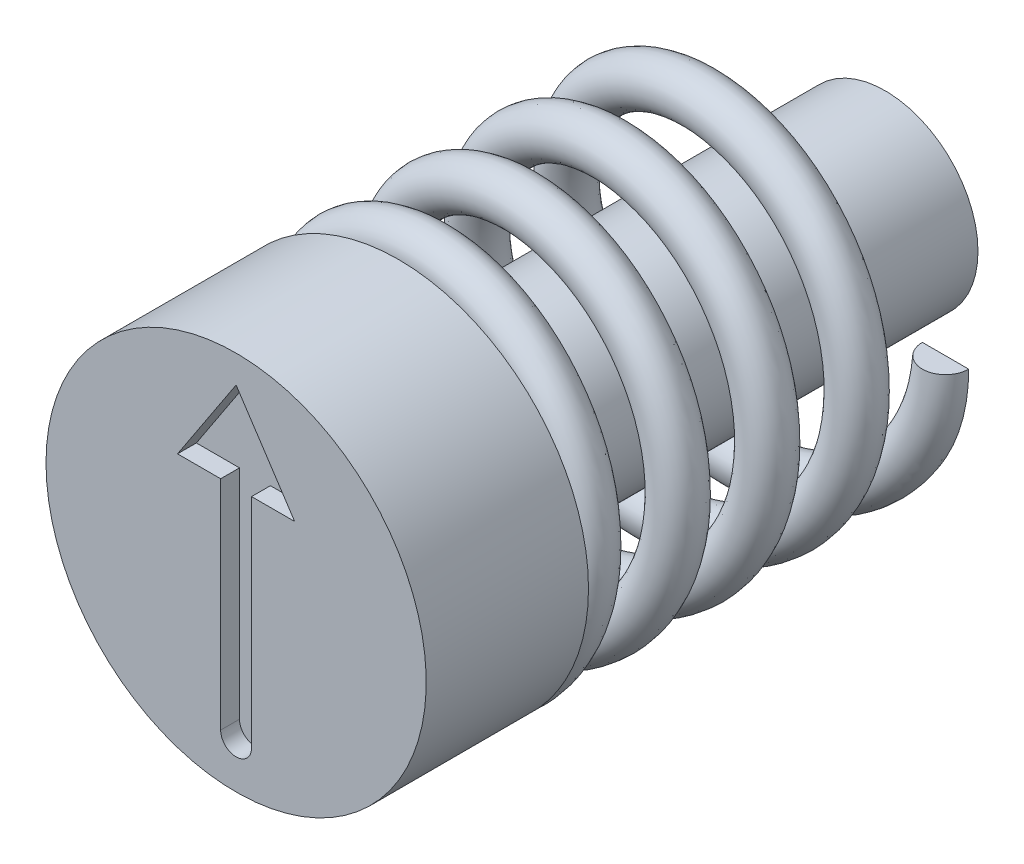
ISO-10303-21;
HEADER;
FILE_DESCRIPTION(('STEP AP214'),'2;1');
FILE_NAME('part.step','',(''),(''),'','','');
FILE_SCHEMA(('AUTOMOTIVE_DESIGN { 1 0 10303 214 1 1 1 1 }'));
ENDSEC;
DATA;
#1=APPLICATION_CONTEXT('core data for automotive mechanical design processes');
#2=APPLICATION_PROTOCOL_DEFINITION('international standard','automotive_design',2000,#1);
#3=PRODUCT_CONTEXT('',#1,'mechanical');
#4=PRODUCT('Part','Part','',(#3));
#5=PRODUCT_RELATED_PRODUCT_CATEGORY('part','',(#4));
#6=PRODUCT_DEFINITION_FORMATION('','',#4);
#7=PRODUCT_DEFINITION_CONTEXT('part definition',#1,'design');
#8=PRODUCT_DEFINITION('design','',#6,#7);
#9=PRODUCT_DEFINITION_SHAPE('','',#8);
#10=(LENGTH_UNIT() NAMED_UNIT(*) SI_UNIT(.MILLI.,.METRE.));
#11=(NAMED_UNIT(*) PLANE_ANGLE_UNIT() SI_UNIT($,.RADIAN.));
#12=(NAMED_UNIT(*) SI_UNIT($,.STERADIAN.) SOLID_ANGLE_UNIT());
#13=UNCERTAINTY_MEASURE_WITH_UNIT(LENGTH_MEASURE(1.E-05),#10,'distance_accuracy_value','');
#14=(GEOMETRIC_REPRESENTATION_CONTEXT(3) GLOBAL_UNCERTAINTY_ASSIGNED_CONTEXT((#13)) GLOBAL_UNIT_ASSIGNED_CONTEXT((#10,
#11,#12)) REPRESENTATION_CONTEXT('',''));
#15=CARTESIAN_POINT('',(0.,0.,0.));
#16=DIRECTION('',(0.,0.,1.));
#17=DIRECTION('',(1.,0.,0.));
#18=AXIS2_PLACEMENT_3D('',#15,#16,#17);
#19=CARTESIAN_POINT('',(3.6,0.,-12.2));
#20=DIRECTION('',(0.,-1.,0.));
#21=DIRECTION('',(0.,0.,-1.));
#22=AXIS2_PLACEMENT_3D('',#19,#20,#21);
#23=PLANE('',#22);
#24=CARTESIAN_POINT('',(3.6,0.,-11.7));
#25=DIRECTION('',(0.,1.,0.));
#26=DIRECTION('',(0.,0.,1.));
#27=AXIS2_PLACEMENT_3D('',#24,#25,#26);
#28=CIRCLE('',#27,0.5);
#29=CARTESIAN_POINT('',(3.1,0.,-11.7));
#30=VERTEX_POINT('',#29);
#31=CARTESIAN_POINT('',(4.1,0.,-11.7));
#32=VERTEX_POINT('',#31);
#33=EDGE_CURVE('E98',#30,#32,#28,.T.);
#34=ORIENTED_EDGE('',*,*,#33,.T.);
#35=DIRECTION('',(-1.,0.,0.));
#36=VECTOR('',#35,1.);
#37=CARTESIAN_POINT('',(3.6,0.,-11.7));
#38=LINE('',#37,#36);
#39=EDGE_CURVE('E78',#32,#30,#38,.T.);
#40=ORIENTED_EDGE('',*,*,#39,.T.);
#41=EDGE_LOOP('',(#34,#40));
#42=FACE_BOUND('',#41,.T.);
#43=ADVANCED_FACE('F51',(#42),#23,.F.);
#44=CARTESIAN_POINT('',(-2.78294577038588E-13,-3.6,-3.99999999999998));
#45=DIRECTION('',(-1.,0.,0.));
#46=DIRECTION('',(0.,-1.,0.));
#47=AXIS2_PLACEMENT_3D('',#44,#45,#46);
#48=PLANE('',#47);
#49=DIRECTION('',(0.,-1.,0.));
#50=VECTOR('',#49,1.);
#51=CARTESIAN_POINT('',(-2.78294577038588E-13,-3.6,-3.5));
#52=LINE('',#51,#50);
#53=CARTESIAN_POINT('',(-2.39645639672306E-13,-3.1,-3.5));
#54=VERTEX_POINT('',#53);
#55=CARTESIAN_POINT('',(-3.1694351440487E-13,-4.1,-3.5));
#56=VERTEX_POINT('',#55);
#57=EDGE_CURVE('E71',#54,#56,#52,.T.);
#58=ORIENTED_EDGE('',*,*,#57,.F.);
#59=CARTESIAN_POINT('',(-2.78294577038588E-13,-3.6,-3.49999999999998));
#60=DIRECTION('',(-1.,0.,0.));
#61=DIRECTION('',(0.,-1.,0.));
#62=AXIS2_PLACEMENT_3D('',#59,#60,#61);
#63=CIRCLE('',#62,0.500000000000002);
#64=EDGE_CURVE('E93',#54,#56,#63,.T.);
#65=ORIENTED_EDGE('',*,*,#64,.T.);
#66=EDGE_LOOP('',(#58,#65));
#67=FACE_BOUND('',#66,.T.);
#68=ADVANCED_FACE('F53',(#67),#48,.T.);
#69=CARTESIAN_POINT('',(3.6,0.,-11.2));
#70=CARTESIAN_POINT('',(3.6,-1.16971090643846,-11.1035294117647));
#71=CARTESIAN_POINT('',(2.91246117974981,-2.1160269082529,-11.0070588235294));
#72=CARTESIAN_POINT('',(2.22492235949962,-3.06234291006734,-10.9105882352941));
#73=CARTESIAN_POINT('',(1.11246117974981,-3.42380345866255,-10.8141176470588));
#74=CARTESIAN_POINT('',(0.,-3.78526400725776,-10.7176470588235));
#75=CARTESIAN_POINT('',(-1.11246117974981,-3.42380345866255,-10.6211764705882));
#76=CARTESIAN_POINT('',(-2.22492235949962,-3.06234291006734,-10.5247058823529));
#77=CARTESIAN_POINT('',(-2.91246117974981,-2.1160269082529,-10.4282352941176));
#78=CARTESIAN_POINT('',(-3.6,-1.16971090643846,-10.3317647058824));
#79=CARTESIAN_POINT('',(-3.6,0.,-10.2352941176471));
#80=CARTESIAN_POINT('',(-3.6,1.16971090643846,-10.1388235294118));
#81=CARTESIAN_POINT('',(-2.91246117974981,2.1160269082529,-10.0423529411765));
#82=CARTESIAN_POINT('',(-2.22492235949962,3.06234291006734,-9.94588235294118));
#83=CARTESIAN_POINT('',(-1.11246117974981,3.42380345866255,-9.84941176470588));
#84=CARTESIAN_POINT('',(0.,3.78526400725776,-9.75294117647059));
#85=CARTESIAN_POINT('',(1.11246117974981,3.42380345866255,-9.65647058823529));
#86=CARTESIAN_POINT('',(2.22492235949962,3.06234291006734,-9.56));
#87=CARTESIAN_POINT('',(2.91246117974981,2.1160269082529,-9.4635294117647));
#88=CARTESIAN_POINT('',(3.6,1.16971090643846,-9.36705882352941));
#89=CARTESIAN_POINT('',(3.6,0.,-9.27058823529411));
#90=CARTESIAN_POINT('',(3.6,-1.16971090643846,-9.17411764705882));
#91=CARTESIAN_POINT('',(2.91246117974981,-2.1160269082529,-9.07764705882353));
#92=CARTESIAN_POINT('',(2.22492235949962,-3.06234291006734,-8.98117647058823));
#93=CARTESIAN_POINT('',(1.11246117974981,-3.42380345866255,-8.88470588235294));
#94=CARTESIAN_POINT('',(0.,-3.78526400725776,-8.78823529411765));
#95=CARTESIAN_POINT('',(-1.11246117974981,-3.42380345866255,-8.69176470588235));
#96=CARTESIAN_POINT('',(-2.22492235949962,-3.06234291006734,-8.59529411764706));
#97=CARTESIAN_POINT('',(-2.91246117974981,-2.1160269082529,-8.49882352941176));
#98=CARTESIAN_POINT('',(-3.6,-1.16971090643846,-8.40235294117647));
#99=CARTESIAN_POINT('',(-3.6,0.,-8.30588235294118));
#100=CARTESIAN_POINT('',(-3.6,1.16971090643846,-8.20941176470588));
#101=CARTESIAN_POINT('',(-2.91246117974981,2.1160269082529,-8.11294117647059));
#102=CARTESIAN_POINT('',(-2.22492235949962,3.06234291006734,-8.01647058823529));
#103=CARTESIAN_POINT('',(-1.11246117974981,3.42380345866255,-7.92));
#104=CARTESIAN_POINT('',(0.,3.78526400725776,-7.8235294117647));
#105=CARTESIAN_POINT('',(1.11246117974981,3.42380345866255,-7.72705882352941));
#106=CARTESIAN_POINT('',(2.22492235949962,3.06234291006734,-7.63058823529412));
#107=CARTESIAN_POINT('',(2.91246117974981,2.1160269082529,-7.53411764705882));
#108=CARTESIAN_POINT('',(3.6,1.16971090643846,-7.43764705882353));
#109=CARTESIAN_POINT('',(3.6,0.,-7.34117647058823));
#110=CARTESIAN_POINT('',(3.6,-1.16971090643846,-7.24470588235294));
#111=CARTESIAN_POINT('',(2.91246117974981,-2.1160269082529,-7.14823529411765));
#112=CARTESIAN_POINT('',(2.22492235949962,-3.06234291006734,-7.05176470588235));
#113=CARTESIAN_POINT('',(1.11246117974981,-3.42380345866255,-6.95529411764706));
#114=CARTESIAN_POINT('',(0.,-3.78526400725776,-6.85882352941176));
#115=CARTESIAN_POINT('',(-1.11246117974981,-3.42380345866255,-6.76235294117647));
#116=CARTESIAN_POINT('',(-2.22492235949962,-3.06234291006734,-6.66588235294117));
#117=CARTESIAN_POINT('',(-2.91246117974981,-2.1160269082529,-6.56941176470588));
#118=CARTESIAN_POINT('',(-3.6,-1.16971090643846,-6.47294117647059));
#119=CARTESIAN_POINT('',(-3.6,0.,-6.37647058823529));
#120=CARTESIAN_POINT('',(-3.6,1.16971090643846,-6.28));
#121=CARTESIAN_POINT('',(-2.91246117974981,2.1160269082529,-6.1835294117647));
#122=CARTESIAN_POINT('',(-2.22492235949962,3.06234291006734,-6.08705882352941));
#123=CARTESIAN_POINT('',(-1.11246117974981,3.42380345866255,-5.99058823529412));
#124=CARTESIAN_POINT('',(0.,3.78526400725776,-5.89411764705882));
#125=CARTESIAN_POINT('',(1.11246117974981,3.42380345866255,-5.79764705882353));
#126=CARTESIAN_POINT('',(2.22492235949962,3.06234291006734,-5.70117647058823));
#127=CARTESIAN_POINT('',(2.91246117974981,2.1160269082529,-5.60470588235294));
#128=CARTESIAN_POINT('',(3.6,1.16971090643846,-5.50823529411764));
#129=CARTESIAN_POINT('',(3.6,0.,-5.41176470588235));
#130=CARTESIAN_POINT('',(3.6,-1.16971090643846,-5.31529411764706));
#131=CARTESIAN_POINT('',(2.91246117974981,-2.1160269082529,-5.21882352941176));
#132=CARTESIAN_POINT('',(2.22492235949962,-3.06234291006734,-5.12235294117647));
#133=CARTESIAN_POINT('',(1.11246117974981,-3.42380345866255,-5.02588235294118));
#134=CARTESIAN_POINT('',(0.,-3.78526400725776,-4.92941176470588));
#135=CARTESIAN_POINT('',(-1.11246117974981,-3.42380345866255,-4.83294117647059));
#136=CARTESIAN_POINT('',(-2.22492235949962,-3.06234291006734,-4.73647058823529));
#137=CARTESIAN_POINT('',(-2.91246117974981,-2.1160269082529,-4.64));
#138=CARTESIAN_POINT('',(-3.6,-1.16971090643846,-4.54352941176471));
#139=CARTESIAN_POINT('',(-3.6,0.,-4.44705882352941));
#140=CARTESIAN_POINT('',(-3.6,1.16971090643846,-4.35058823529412));
#141=CARTESIAN_POINT('',(-2.91246117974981,2.1160269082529,-4.25411764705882));
#142=CARTESIAN_POINT('',(-2.22492235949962,3.06234291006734,-4.15764705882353));
#143=CARTESIAN_POINT('',(-1.11246117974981,3.42380345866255,-4.06117647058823));
#144=CARTESIAN_POINT('',(0.,3.78526400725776,-3.96470588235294));
#145=CARTESIAN_POINT('',(1.11246117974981,3.42380345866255,-3.86823529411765));
#146=CARTESIAN_POINT('',(2.22492235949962,3.06234291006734,-3.77176470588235));
#147=CARTESIAN_POINT('',(2.91246117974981,2.1160269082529,-3.67529411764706));
#148=CARTESIAN_POINT('',(3.6,1.16971090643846,-3.57882352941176));
#149=CARTESIAN_POINT('',(3.6,0.,-3.48235294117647));
#150=CARTESIAN_POINT('',(3.6,-1.16971090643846,-3.38588235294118));
#151=CARTESIAN_POINT('',(2.91246117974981,-2.1160269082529,-3.28941176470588));
#152=CARTESIAN_POINT('',(2.22492235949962,-3.06234291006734,-3.19294117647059));
#153=CARTESIAN_POINT('',(1.11246117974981,-3.42380345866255,-3.09647058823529));
#154=CARTESIAN_POINT('',(0.570183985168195,-3.60000000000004,-3.049445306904));
#155=CARTESIAN_POINT('',(-2.78294577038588E-13,-3.6,-2.99999999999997));
#156=CARTESIAN_POINT('',(4.6,0.,-11.2));
#157=CARTESIAN_POINT('',(4.6,-1.49463060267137,-11.1035294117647));
#158=CARTESIAN_POINT('',(3.72147817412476,-2.70381216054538,-11.0070588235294));
#159=CARTESIAN_POINT('',(2.84295634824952,-3.91299371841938,-10.9105882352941));
#160=CARTESIAN_POINT('',(1.42147817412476,-4.37485997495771,-10.8141176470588));
#161=CARTESIAN_POINT('',(0.,-4.83672623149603,-10.7176470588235));
#162=CARTESIAN_POINT('',(-1.42147817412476,-4.37485997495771,-10.6211764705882));
#163=CARTESIAN_POINT('',(-2.84295634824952,-3.91299371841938,-10.5247058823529));
#164=CARTESIAN_POINT('',(-3.72147817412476,-2.70381216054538,-10.4282352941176));
#165=CARTESIAN_POINT('',(-4.6,-1.49463060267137,-10.3317647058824));
#166=CARTESIAN_POINT('',(-4.6,0.,-10.2352941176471));
#167=CARTESIAN_POINT('',(-4.6,1.49463060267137,-10.1388235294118));
#168=CARTESIAN_POINT('',(-3.72147817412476,2.70381216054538,-10.0423529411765));
#169=CARTESIAN_POINT('',(-2.84295634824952,3.91299371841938,-9.94588235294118));
#170=CARTESIAN_POINT('',(-1.42147817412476,4.37485997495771,-9.84941176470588));
#171=CARTESIAN_POINT('',(0.,4.83672623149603,-9.75294117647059));
#172=CARTESIAN_POINT('',(1.42147817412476,4.37485997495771,-9.65647058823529));
#173=CARTESIAN_POINT('',(2.84295634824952,3.91299371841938,-9.56));
#174=CARTESIAN_POINT('',(3.72147817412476,2.70381216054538,-9.4635294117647));
#175=CARTESIAN_POINT('',(4.6,1.49463060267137,-9.36705882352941));
#176=CARTESIAN_POINT('',(4.6,0.,-9.27058823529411));
#177=CARTESIAN_POINT('',(4.6,-1.49463060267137,-9.17411764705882));
#178=CARTESIAN_POINT('',(3.72147817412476,-2.70381216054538,-9.07764705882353));
#179=CARTESIAN_POINT('',(2.84295634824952,-3.91299371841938,-8.98117647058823));
#180=CARTESIAN_POINT('',(1.42147817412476,-4.37485997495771,-8.88470588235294));
#181=CARTESIAN_POINT('',(0.,-4.83672623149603,-8.78823529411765));
#182=CARTESIAN_POINT('',(-1.42147817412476,-4.37485997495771,-8.69176470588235));
#183=CARTESIAN_POINT('',(-2.84295634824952,-3.91299371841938,-8.59529411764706));
#184=CARTESIAN_POINT('',(-3.72147817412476,-2.70381216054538,-8.49882352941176));
#185=CARTESIAN_POINT('',(-4.6,-1.49463060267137,-8.40235294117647));
#186=CARTESIAN_POINT('',(-4.6,0.,-8.30588235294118));
#187=CARTESIAN_POINT('',(-4.6,1.49463060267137,-8.20941176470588));
#188=CARTESIAN_POINT('',(-3.72147817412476,2.70381216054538,-8.11294117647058));
#189=CARTESIAN_POINT('',(-2.84295634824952,3.91299371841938,-8.01647058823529));
#190=CARTESIAN_POINT('',(-1.42147817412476,4.37485997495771,-7.92));
#191=CARTESIAN_POINT('',(0.,4.83672623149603,-7.8235294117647));
#192=CARTESIAN_POINT('',(1.42147817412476,4.37485997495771,-7.72705882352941));
#193=CARTESIAN_POINT('',(2.84295634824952,3.91299371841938,-7.63058823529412));
#194=CARTESIAN_POINT('',(3.72147817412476,2.70381216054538,-7.53411764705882));
#195=CARTESIAN_POINT('',(4.6,1.49463060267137,-7.43764705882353));
#196=CARTESIAN_POINT('',(4.6,0.,-7.34117647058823));
#197=CARTESIAN_POINT('',(4.6,-1.49463060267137,-7.24470588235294));
#198=CARTESIAN_POINT('',(3.72147817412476,-2.70381216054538,-7.14823529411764));
#199=CARTESIAN_POINT('',(2.84295634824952,-3.91299371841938,-7.05176470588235));
#200=CARTESIAN_POINT('',(1.42147817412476,-4.37485997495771,-6.95529411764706));
#201=CARTESIAN_POINT('',(0.,-4.83672623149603,-6.85882352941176));
#202=CARTESIAN_POINT('',(-1.42147817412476,-4.37485997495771,-6.76235294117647));
#203=CARTESIAN_POINT('',(-2.84295634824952,-3.91299371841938,-6.66588235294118));
#204=CARTESIAN_POINT('',(-3.72147817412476,-2.70381216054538,-6.56941176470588));
#205=CARTESIAN_POINT('',(-4.6,-1.49463060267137,-6.47294117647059));
#206=CARTESIAN_POINT('',(-4.6,0.,-6.37647058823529));
#207=CARTESIAN_POINT('',(-4.6,1.49463060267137,-6.28));
#208=CARTESIAN_POINT('',(-3.72147817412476,2.70381216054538,-6.1835294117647));
#209=CARTESIAN_POINT('',(-2.84295634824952,3.91299371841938,-6.08705882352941));
#210=CARTESIAN_POINT('',(-1.42147817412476,4.37485997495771,-5.99058823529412));
#211=CARTESIAN_POINT('',(0.,4.83672623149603,-5.89411764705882));
#212=CARTESIAN_POINT('',(1.42147817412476,4.37485997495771,-5.79764705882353));
#213=CARTESIAN_POINT('',(2.84295634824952,3.91299371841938,-5.70117647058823));
#214=CARTESIAN_POINT('',(3.72147817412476,2.70381216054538,-5.60470588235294));
#215=CARTESIAN_POINT('',(4.6,1.49463060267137,-5.50823529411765));
#216=CARTESIAN_POINT('',(4.6,0.,-5.41176470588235));
#217=CARTESIAN_POINT('',(4.6,-1.49463060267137,-5.31529411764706));
#218=CARTESIAN_POINT('',(3.72147817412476,-2.70381216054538,-5.21882352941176));
#219=CARTESIAN_POINT('',(2.84295634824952,-3.91299371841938,-5.12235294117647));
#220=CARTESIAN_POINT('',(1.42147817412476,-4.37485997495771,-5.02588235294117));
#221=CARTESIAN_POINT('',(0.,-4.83672623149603,-4.92941176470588));
#222=CARTESIAN_POINT('',(-1.42147817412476,-4.37485997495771,-4.83294117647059));
#223=CARTESIAN_POINT('',(-2.84295634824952,-3.91299371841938,-4.73647058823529));
#224=CARTESIAN_POINT('',(-3.72147817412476,-2.70381216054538,-4.64));
#225=CARTESIAN_POINT('',(-4.6,-1.49463060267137,-4.54352941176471));
#226=CARTESIAN_POINT('',(-4.6,0.,-4.44705882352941));
#227=CARTESIAN_POINT('',(-4.6,1.49463060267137,-4.35058823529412));
#228=CARTESIAN_POINT('',(-3.72147817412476,2.70381216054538,-4.25411764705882));
#229=CARTESIAN_POINT('',(-2.84295634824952,3.91299371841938,-4.15764705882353));
#230=CARTESIAN_POINT('',(-1.42147817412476,4.37485997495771,-4.06117647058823));
#231=CARTESIAN_POINT('',(0.,4.83672623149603,-3.96470588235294));
#232=CARTESIAN_POINT('',(1.42147817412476,4.37485997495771,-3.86823529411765));
#233=CARTESIAN_POINT('',(2.84295634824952,3.91299371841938,-3.77176470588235));
#234=CARTESIAN_POINT('',(3.72147817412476,2.70381216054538,-3.67529411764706));
#235=CARTESIAN_POINT('',(4.6,1.49463060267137,-3.57882352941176));
#236=CARTESIAN_POINT('',(4.6,0.,-3.48235294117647));
#237=CARTESIAN_POINT('',(4.6,-1.49463060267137,-3.38588235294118));
#238=CARTESIAN_POINT('',(3.72147817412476,-2.70381216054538,-3.28941176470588));
#239=CARTESIAN_POINT('',(2.84295634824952,-3.91299371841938,-3.19294117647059));
#240=CARTESIAN_POINT('',(1.42147817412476,-4.37485997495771,-3.09647058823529));
#241=CARTESIAN_POINT('',(0.728568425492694,-4.60000000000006,-3.049445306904));
#242=CARTESIAN_POINT('',(-3.55592451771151E-13,-4.6,-2.99999999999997));
#243=CARTESIAN_POINT('',(4.6,0.,-12.2));
#244=CARTESIAN_POINT('',(4.6,-1.49463060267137,-12.1035294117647));
#245=CARTESIAN_POINT('',(3.72147817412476,-2.70381216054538,-12.0070588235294));
#246=CARTESIAN_POINT('',(2.84295634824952,-3.91299371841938,-11.9105882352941));
#247=CARTESIAN_POINT('',(1.42147817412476,-4.37485997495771,-11.8141176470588));
#248=CARTESIAN_POINT('',(0.,-4.83672623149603,-11.7176470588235));
#249=CARTESIAN_POINT('',(-1.42147817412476,-4.37485997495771,-11.6211764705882));
#250=CARTESIAN_POINT('',(-2.84295634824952,-3.91299371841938,-11.5247058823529));
#251=CARTESIAN_POINT('',(-3.72147817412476,-2.70381216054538,-11.4282352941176));
#252=CARTESIAN_POINT('',(-4.6,-1.49463060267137,-11.3317647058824));
#253=CARTESIAN_POINT('',(-4.6,0.,-11.2352941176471));
#254=CARTESIAN_POINT('',(-4.6,1.49463060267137,-11.1388235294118));
#255=CARTESIAN_POINT('',(-3.72147817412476,2.70381216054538,-11.0423529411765));
#256=CARTESIAN_POINT('',(-2.84295634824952,3.91299371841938,-10.9458823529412));
#257=CARTESIAN_POINT('',(-1.42147817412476,4.37485997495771,-10.8494117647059));
#258=CARTESIAN_POINT('',(0.,4.83672623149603,-10.7529411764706));
#259=CARTESIAN_POINT('',(1.42147817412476,4.37485997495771,-10.6564705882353));
#260=CARTESIAN_POINT('',(2.84295634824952,3.91299371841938,-10.56));
#261=CARTESIAN_POINT('',(3.72147817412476,2.70381216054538,-10.4635294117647));
#262=CARTESIAN_POINT('',(4.6,1.49463060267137,-10.3670588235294));
#263=CARTESIAN_POINT('',(4.6,0.,-10.2705882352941));
#264=CARTESIAN_POINT('',(4.6,-1.49463060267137,-10.1741176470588));
#265=CARTESIAN_POINT('',(3.72147817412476,-2.70381216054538,-10.0776470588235));
#266=CARTESIAN_POINT('',(2.84295634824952,-3.91299371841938,-9.98117647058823));
#267=CARTESIAN_POINT('',(1.42147817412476,-4.37485997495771,-9.88470588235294));
#268=CARTESIAN_POINT('',(0.,-4.83672623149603,-9.78823529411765));
#269=CARTESIAN_POINT('',(-1.42147817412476,-4.37485997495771,-9.69176470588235));
#270=CARTESIAN_POINT('',(-2.84295634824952,-3.91299371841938,-9.59529411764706));
#271=CARTESIAN_POINT('',(-3.72147817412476,-2.70381216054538,-9.49882352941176));
#272=CARTESIAN_POINT('',(-4.6,-1.49463060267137,-9.40235294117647));
#273=CARTESIAN_POINT('',(-4.6,0.,-9.30588235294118));
#274=CARTESIAN_POINT('',(-4.6,1.49463060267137,-9.20941176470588));
#275=CARTESIAN_POINT('',(-3.72147817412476,2.70381216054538,-9.11294117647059));
#276=CARTESIAN_POINT('',(-2.84295634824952,3.91299371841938,-9.01647058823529));
#277=CARTESIAN_POINT('',(-1.42147817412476,4.37485997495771,-8.92));
#278=CARTESIAN_POINT('',(0.,4.83672623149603,-8.82352941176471));
#279=CARTESIAN_POINT('',(1.42147817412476,4.37485997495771,-8.72705882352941));
#280=CARTESIAN_POINT('',(2.84295634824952,3.91299371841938,-8.63058823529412));
#281=CARTESIAN_POINT('',(3.72147817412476,2.70381216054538,-8.53411764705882));
#282=CARTESIAN_POINT('',(4.6,1.49463060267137,-8.43764705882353));
#283=CARTESIAN_POINT('',(4.6,0.,-8.34117647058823));
#284=CARTESIAN_POINT('',(4.6,-1.49463060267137,-8.24470588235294));
#285=CARTESIAN_POINT('',(3.72147817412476,-2.70381216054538,-8.14823529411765));
#286=CARTESIAN_POINT('',(2.84295634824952,-3.91299371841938,-8.05176470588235));
#287=CARTESIAN_POINT('',(1.42147817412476,-4.37485997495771,-7.95529411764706));
#288=CARTESIAN_POINT('',(0.,-4.83672623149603,-7.85882352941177));
#289=CARTESIAN_POINT('',(-1.42147817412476,-4.37485997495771,-7.76235294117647));
#290=CARTESIAN_POINT('',(-2.84295634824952,-3.91299371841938,-7.66588235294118));
#291=CARTESIAN_POINT('',(-3.72147817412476,-2.70381216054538,-7.56941176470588));
#292=CARTESIAN_POINT('',(-4.6,-1.49463060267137,-7.47294117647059));
#293=CARTESIAN_POINT('',(-4.6,0.,-7.37647058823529));
#294=CARTESIAN_POINT('',(-4.6,1.49463060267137,-7.28));
#295=CARTESIAN_POINT('',(-3.72147817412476,2.70381216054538,-7.18352941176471));
#296=CARTESIAN_POINT('',(-2.84295634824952,3.91299371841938,-7.08705882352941));
#297=CARTESIAN_POINT('',(-1.42147817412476,4.37485997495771,-6.99058823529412));
#298=CARTESIAN_POINT('',(0.,4.83672623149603,-6.89411764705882));
#299=CARTESIAN_POINT('',(1.42147817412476,4.37485997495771,-6.79764705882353));
#300=CARTESIAN_POINT('',(2.84295634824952,3.91299371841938,-6.70117647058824));
#301=CARTESIAN_POINT('',(3.72147817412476,2.70381216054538,-6.60470588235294));
#302=CARTESIAN_POINT('',(4.6,1.49463060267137,-6.50823529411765));
#303=CARTESIAN_POINT('',(4.6,0.,-6.41176470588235));
#304=CARTESIAN_POINT('',(4.6,-1.49463060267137,-6.31529411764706));
#305=CARTESIAN_POINT('',(3.72147817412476,-2.70381216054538,-6.21882352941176));
#306=CARTESIAN_POINT('',(2.84295634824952,-3.91299371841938,-6.12235294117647));
#307=CARTESIAN_POINT('',(1.42147817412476,-4.37485997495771,-6.02588235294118));
#308=CARTESIAN_POINT('',(0.,-4.83672623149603,-5.92941176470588));
#309=CARTESIAN_POINT('',(-1.42147817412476,-4.37485997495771,-5.83294117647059));
#310=CARTESIAN_POINT('',(-2.84295634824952,-3.91299371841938,-5.73647058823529));
#311=CARTESIAN_POINT('',(-3.72147817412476,-2.70381216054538,-5.64));
#312=CARTESIAN_POINT('',(-4.6,-1.49463060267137,-5.54352941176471));
#313=CARTESIAN_POINT('',(-4.6,0.,-5.44705882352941));
#314=CARTESIAN_POINT('',(-4.6,1.49463060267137,-5.35058823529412));
#315=CARTESIAN_POINT('',(-3.72147817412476,2.70381216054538,-5.25411764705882));
#316=CARTESIAN_POINT('',(-2.84295634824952,3.91299371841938,-5.15764705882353));
#317=CARTESIAN_POINT('',(-1.42147817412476,4.37485997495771,-5.06117647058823));
#318=CARTESIAN_POINT('',(0.,4.83672623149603,-4.96470588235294));
#319=CARTESIAN_POINT('',(1.42147817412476,4.37485997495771,-4.86823529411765));
#320=CARTESIAN_POINT('',(2.84295634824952,3.91299371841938,-4.77176470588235));
#321=CARTESIAN_POINT('',(3.72147817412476,2.70381216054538,-4.67529411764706));
#322=CARTESIAN_POINT('',(4.6,1.49463060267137,-4.57882352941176));
#323=CARTESIAN_POINT('',(4.6,0.,-4.48235294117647));
#324=CARTESIAN_POINT('',(4.6,-1.49463060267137,-4.38588235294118));
#325=CARTESIAN_POINT('',(3.72147817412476,-2.70381216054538,-4.28941176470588));
#326=CARTESIAN_POINT('',(2.84295634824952,-3.91299371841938,-4.19294117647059));
#327=CARTESIAN_POINT('',(1.42147817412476,-4.37485997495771,-4.09647058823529));
#328=CARTESIAN_POINT('',(0.728568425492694,-4.60000000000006,-4.049445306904));
#329=CARTESIAN_POINT('',(-3.55592451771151E-13,-4.6,-3.99999999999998));
#330=CARTESIAN_POINT('',(3.6,0.,-12.2));
#331=CARTESIAN_POINT('',(3.6,-1.16971090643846,-12.1035294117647));
#332=CARTESIAN_POINT('',(2.91246117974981,-2.1160269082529,-12.0070588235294));
#333=CARTESIAN_POINT('',(2.22492235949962,-3.06234291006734,-11.9105882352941));
#334=CARTESIAN_POINT('',(1.11246117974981,-3.42380345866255,-11.8141176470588));
#335=CARTESIAN_POINT('',(0.,-3.78526400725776,-11.7176470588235));
#336=CARTESIAN_POINT('',(-1.11246117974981,-3.42380345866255,-11.6211764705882));
#337=CARTESIAN_POINT('',(-2.22492235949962,-3.06234291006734,-11.5247058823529));
#338=CARTESIAN_POINT('',(-2.91246117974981,-2.1160269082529,-11.4282352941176));
#339=CARTESIAN_POINT('',(-3.6,-1.16971090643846,-11.3317647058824));
#340=CARTESIAN_POINT('',(-3.6,0.,-11.2352941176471));
#341=CARTESIAN_POINT('',(-3.6,1.16971090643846,-11.1388235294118));
#342=CARTESIAN_POINT('',(-2.91246117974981,2.1160269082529,-11.0423529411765));
#343=CARTESIAN_POINT('',(-2.22492235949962,3.06234291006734,-10.9458823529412));
#344=CARTESIAN_POINT('',(-1.11246117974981,3.42380345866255,-10.8494117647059));
#345=CARTESIAN_POINT('',(0.,3.78526400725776,-10.7529411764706));
#346=CARTESIAN_POINT('',(1.11246117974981,3.42380345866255,-10.6564705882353));
#347=CARTESIAN_POINT('',(2.22492235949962,3.06234291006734,-10.56));
#348=CARTESIAN_POINT('',(2.91246117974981,2.1160269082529,-10.4635294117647));
#349=CARTESIAN_POINT('',(3.6,1.16971090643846,-10.3670588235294));
#350=CARTESIAN_POINT('',(3.6,0.,-10.2705882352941));
#351=CARTESIAN_POINT('',(3.6,-1.16971090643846,-10.1741176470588));
#352=CARTESIAN_POINT('',(2.91246117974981,-2.1160269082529,-10.0776470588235));
#353=CARTESIAN_POINT('',(2.22492235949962,-3.06234291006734,-9.98117647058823));
#354=CARTESIAN_POINT('',(1.11246117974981,-3.42380345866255,-9.88470588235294));
#355=CARTESIAN_POINT('',(0.,-3.78526400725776,-9.78823529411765));
#356=CARTESIAN_POINT('',(-1.11246117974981,-3.42380345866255,-9.69176470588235));
#357=CARTESIAN_POINT('',(-2.22492235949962,-3.06234291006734,-9.59529411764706));
#358=CARTESIAN_POINT('',(-2.91246117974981,-2.1160269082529,-9.49882352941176));
#359=CARTESIAN_POINT('',(-3.6,-1.16971090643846,-9.40235294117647));
#360=CARTESIAN_POINT('',(-3.6,0.,-9.30588235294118));
#361=CARTESIAN_POINT('',(-3.6,1.16971090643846,-9.20941176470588));
#362=CARTESIAN_POINT('',(-2.91246117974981,2.1160269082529,-9.11294117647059));
#363=CARTESIAN_POINT('',(-2.22492235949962,3.06234291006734,-9.01647058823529));
#364=CARTESIAN_POINT('',(-1.11246117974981,3.42380345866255,-8.92));
#365=CARTESIAN_POINT('',(0.,3.78526400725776,-8.82352941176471));
#366=CARTESIAN_POINT('',(1.11246117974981,3.42380345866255,-8.72705882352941));
#367=CARTESIAN_POINT('',(2.22492235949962,3.06234291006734,-8.63058823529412));
#368=CARTESIAN_POINT('',(2.91246117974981,2.1160269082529,-8.53411764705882));
#369=CARTESIAN_POINT('',(3.6,1.16971090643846,-8.43764705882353));
#370=CARTESIAN_POINT('',(3.6,0.,-8.34117647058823));
#371=CARTESIAN_POINT('',(3.6,-1.16971090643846,-8.24470588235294));
#372=CARTESIAN_POINT('',(2.91246117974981,-2.1160269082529,-8.14823529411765));
#373=CARTESIAN_POINT('',(2.22492235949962,-3.06234291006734,-8.05176470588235));
#374=CARTESIAN_POINT('',(1.11246117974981,-3.42380345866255,-7.95529411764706));
#375=CARTESIAN_POINT('',(0.,-3.78526400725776,-7.85882352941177));
#376=CARTESIAN_POINT('',(-1.11246117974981,-3.42380345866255,-7.76235294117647));
#377=CARTESIAN_POINT('',(-2.22492235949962,-3.06234291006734,-7.66588235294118));
#378=CARTESIAN_POINT('',(-2.91246117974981,-2.1160269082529,-7.56941176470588));
#379=CARTESIAN_POINT('',(-3.6,-1.16971090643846,-7.47294117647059));
#380=CARTESIAN_POINT('',(-3.6,0.,-7.37647058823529));
#381=CARTESIAN_POINT('',(-3.6,1.16971090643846,-7.28));
#382=CARTESIAN_POINT('',(-2.91246117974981,2.1160269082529,-7.18352941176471));
#383=CARTESIAN_POINT('',(-2.22492235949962,3.06234291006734,-7.08705882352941));
#384=CARTESIAN_POINT('',(-1.11246117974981,3.42380345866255,-6.99058823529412));
#385=CARTESIAN_POINT('',(0.,3.78526400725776,-6.89411764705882));
#386=CARTESIAN_POINT('',(1.11246117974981,3.42380345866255,-6.79764705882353));
#387=CARTESIAN_POINT('',(2.22492235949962,3.06234291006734,-6.70117647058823));
#388=CARTESIAN_POINT('',(2.91246117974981,2.1160269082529,-6.60470588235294));
#389=CARTESIAN_POINT('',(3.6,1.16971090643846,-6.50823529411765));
#390=CARTESIAN_POINT('',(3.6,0.,-6.41176470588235));
#391=CARTESIAN_POINT('',(3.6,-1.16971090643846,-6.31529411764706));
#392=CARTESIAN_POINT('',(2.91246117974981,-2.1160269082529,-6.21882352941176));
#393=CARTESIAN_POINT('',(2.22492235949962,-3.06234291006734,-6.12235294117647));
#394=CARTESIAN_POINT('',(1.11246117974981,-3.42380345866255,-6.02588235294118));
#395=CARTESIAN_POINT('',(0.,-3.78526400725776,-5.92941176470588));
#396=CARTESIAN_POINT('',(-1.11246117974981,-3.42380345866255,-5.83294117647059));
#397=CARTESIAN_POINT('',(-2.22492235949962,-3.06234291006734,-5.73647058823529));
#398=CARTESIAN_POINT('',(-2.91246117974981,-2.1160269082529,-5.64));
#399=CARTESIAN_POINT('',(-3.6,-1.16971090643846,-5.54352941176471));
#400=CARTESIAN_POINT('',(-3.6,0.,-5.44705882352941));
#401=CARTESIAN_POINT('',(-3.6,1.16971090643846,-5.35058823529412));
#402=CARTESIAN_POINT('',(-2.91246117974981,2.1160269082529,-5.25411764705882));
#403=CARTESIAN_POINT('',(-2.22492235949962,3.06234291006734,-5.15764705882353));
#404=CARTESIAN_POINT('',(-1.11246117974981,3.42380345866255,-5.06117647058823));
#405=CARTESIAN_POINT('',(0.,3.78526400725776,-4.96470588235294));
#406=CARTESIAN_POINT('',(1.11246117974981,3.42380345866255,-4.86823529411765));
#407=CARTESIAN_POINT('',(2.22492235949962,3.06234291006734,-4.77176470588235));
#408=CARTESIAN_POINT('',(2.91246117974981,2.1160269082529,-4.67529411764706));
#409=CARTESIAN_POINT('',(3.6,1.16971090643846,-4.57882352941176));
#410=CARTESIAN_POINT('',(3.6,0.,-4.48235294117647));
#411=CARTESIAN_POINT('',(3.6,-1.16971090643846,-4.38588235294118));
#412=CARTESIAN_POINT('',(2.91246117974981,-2.1160269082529,-4.28941176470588));
#413=CARTESIAN_POINT('',(2.22492235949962,-3.06234291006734,-4.19294117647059));
#414=CARTESIAN_POINT('',(1.11246117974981,-3.42380345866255,-4.09647058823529));
#415=CARTESIAN_POINT('',(0.570183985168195,-3.60000000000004,-4.049445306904));
#416=CARTESIAN_POINT('',(-2.78294577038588E-13,-3.6,-3.99999999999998));
#417=CARTESIAN_POINT('',(2.6,0.,-12.2));
#418=CARTESIAN_POINT('',(2.6,-0.844791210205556,-12.1035294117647));
#419=CARTESIAN_POINT('',(2.10344418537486,-1.52824165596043,-12.0070588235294));
#420=CARTESIAN_POINT('',(1.60688837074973,-2.2116921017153,-11.9105882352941));
#421=CARTESIAN_POINT('',(0.803444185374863,-2.4727469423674,-11.8141176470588));
#422=CARTESIAN_POINT('',(0.,-2.73380178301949,-11.7176470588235));
#423=CARTESIAN_POINT('',(-0.803444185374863,-2.4727469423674,-11.6211764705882));
#424=CARTESIAN_POINT('',(-1.60688837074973,-2.2116921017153,-11.5247058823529));
#425=CARTESIAN_POINT('',(-2.10344418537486,-1.52824165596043,-11.4282352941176));
#426=CARTESIAN_POINT('',(-2.6,-0.844791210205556,-11.3317647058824));
#427=CARTESIAN_POINT('',(-2.6,0.,-11.2352941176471));
#428=CARTESIAN_POINT('',(-2.6,0.844791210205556,-11.1388235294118));
#429=CARTESIAN_POINT('',(-2.10344418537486,1.52824165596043,-11.0423529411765));
#430=CARTESIAN_POINT('',(-1.60688837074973,2.2116921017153,-10.9458823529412));
#431=CARTESIAN_POINT('',(-0.803444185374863,2.4727469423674,-10.8494117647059));
#432=CARTESIAN_POINT('',(0.,2.73380178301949,-10.7529411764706));
#433=CARTESIAN_POINT('',(0.803444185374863,2.4727469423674,-10.6564705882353));
#434=CARTESIAN_POINT('',(1.60688837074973,2.2116921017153,-10.56));
#435=CARTESIAN_POINT('',(2.10344418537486,1.52824165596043,-10.4635294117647));
#436=CARTESIAN_POINT('',(2.6,0.844791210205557,-10.3670588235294));
#437=CARTESIAN_POINT('',(2.6,0.,-10.2705882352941));
#438=CARTESIAN_POINT('',(2.6,-0.844791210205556,-10.1741176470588));
#439=CARTESIAN_POINT('',(2.10344418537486,-1.52824165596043,-10.0776470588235));
#440=CARTESIAN_POINT('',(1.60688837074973,-2.2116921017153,-9.98117647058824));
#441=CARTESIAN_POINT('',(0.803444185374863,-2.4727469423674,-9.88470588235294));
#442=CARTESIAN_POINT('',(0.,-2.73380178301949,-9.78823529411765));
#443=CARTESIAN_POINT('',(-0.803444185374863,-2.4727469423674,-9.69176470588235));
#444=CARTESIAN_POINT('',(-1.60688837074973,-2.2116921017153,-9.59529411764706));
#445=CARTESIAN_POINT('',(-2.10344418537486,-1.52824165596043,-9.49882352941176));
#446=CARTESIAN_POINT('',(-2.6,-0.844791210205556,-9.40235294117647));
#447=CARTESIAN_POINT('',(-2.6,0.,-9.30588235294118));
#448=CARTESIAN_POINT('',(-2.6,0.844791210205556,-9.20941176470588));
#449=CARTESIAN_POINT('',(-2.10344418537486,1.52824165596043,-9.11294117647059));
#450=CARTESIAN_POINT('',(-1.60688837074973,2.2116921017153,-9.01647058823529));
#451=CARTESIAN_POINT('',(-0.803444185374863,2.4727469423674,-8.92));
#452=CARTESIAN_POINT('',(0.,2.73380178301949,-8.82352941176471));
#453=CARTESIAN_POINT('',(0.803444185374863,2.4727469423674,-8.72705882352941));
#454=CARTESIAN_POINT('',(1.60688837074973,2.2116921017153,-8.63058823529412));
#455=CARTESIAN_POINT('',(2.10344418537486,1.52824165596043,-8.53411764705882));
#456=CARTESIAN_POINT('',(2.6,0.844791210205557,-8.43764705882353));
#457=CARTESIAN_POINT('',(2.6,0.,-8.34117647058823));
#458=CARTESIAN_POINT('',(2.6,-0.844791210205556,-8.24470588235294));
#459=CARTESIAN_POINT('',(2.10344418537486,-1.52824165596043,-8.14823529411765));
#460=CARTESIAN_POINT('',(1.60688837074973,-2.2116921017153,-8.05176470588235));
#461=CARTESIAN_POINT('',(0.803444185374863,-2.4727469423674,-7.95529411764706));
#462=CARTESIAN_POINT('',(0.,-2.73380178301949,-7.85882352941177));
#463=CARTESIAN_POINT('',(-0.803444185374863,-2.4727469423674,-7.76235294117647));
#464=CARTESIAN_POINT('',(-1.60688837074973,-2.2116921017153,-7.66588235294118));
#465=CARTESIAN_POINT('',(-2.10344418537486,-1.52824165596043,-7.56941176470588));
#466=CARTESIAN_POINT('',(-2.6,-0.844791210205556,-7.47294117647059));
#467=CARTESIAN_POINT('',(-2.6,0.,-7.37647058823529));
#468=CARTESIAN_POINT('',(-2.6,0.844791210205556,-7.28));
#469=CARTESIAN_POINT('',(-2.10344418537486,1.52824165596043,-7.18352941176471));
#470=CARTESIAN_POINT('',(-1.60688837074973,2.2116921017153,-7.08705882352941));
#471=CARTESIAN_POINT('',(-0.803444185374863,2.4727469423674,-6.99058823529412));
#472=CARTESIAN_POINT('',(0.,2.73380178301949,-6.89411764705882));
#473=CARTESIAN_POINT('',(0.803444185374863,2.4727469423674,-6.79764705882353));
#474=CARTESIAN_POINT('',(1.60688837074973,2.2116921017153,-6.70117647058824));
#475=CARTESIAN_POINT('',(2.10344418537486,1.52824165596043,-6.60470588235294));
#476=CARTESIAN_POINT('',(2.6,0.844791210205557,-6.50823529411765));
#477=CARTESIAN_POINT('',(2.6,0.,-6.41176470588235));
#478=CARTESIAN_POINT('',(2.6,-0.844791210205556,-6.31529411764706));
#479=CARTESIAN_POINT('',(2.10344418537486,-1.52824165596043,-6.21882352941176));
#480=CARTESIAN_POINT('',(1.60688837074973,-2.2116921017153,-6.12235294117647));
#481=CARTESIAN_POINT('',(0.803444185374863,-2.4727469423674,-6.02588235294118));
#482=CARTESIAN_POINT('',(0.,-2.73380178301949,-5.92941176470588));
#483=CARTESIAN_POINT('',(-0.803444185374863,-2.4727469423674,-5.83294117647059));
#484=CARTESIAN_POINT('',(-1.60688837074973,-2.2116921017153,-5.73647058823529));
#485=CARTESIAN_POINT('',(-2.10344418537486,-1.52824165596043,-5.64));
#486=CARTESIAN_POINT('',(-2.6,-0.844791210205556,-5.54352941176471));
#487=CARTESIAN_POINT('',(-2.6,0.,-5.44705882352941));
#488=CARTESIAN_POINT('',(-2.6,0.844791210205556,-5.35058823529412));
#489=CARTESIAN_POINT('',(-2.10344418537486,1.52824165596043,-5.25411764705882));
#490=CARTESIAN_POINT('',(-1.60688837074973,2.2116921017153,-5.15764705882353));
#491=CARTESIAN_POINT('',(-0.803444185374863,2.4727469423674,-5.06117647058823));
#492=CARTESIAN_POINT('',(0.,2.73380178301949,-4.96470588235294));
#493=CARTESIAN_POINT('',(0.803444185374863,2.4727469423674,-4.86823529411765));
#494=CARTESIAN_POINT('',(1.60688837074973,2.2116921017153,-4.77176470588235));
#495=CARTESIAN_POINT('',(2.10344418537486,1.52824165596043,-4.67529411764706));
#496=CARTESIAN_POINT('',(2.6,0.844791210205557,-4.57882352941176));
#497=CARTESIAN_POINT('',(2.6,0.,-4.48235294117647));
#498=CARTESIAN_POINT('',(2.6,-0.844791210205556,-4.38588235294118));
#499=CARTESIAN_POINT('',(2.10344418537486,-1.52824165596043,-4.28941176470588));
#500=CARTESIAN_POINT('',(1.60688837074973,-2.2116921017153,-4.19294117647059));
#501=CARTESIAN_POINT('',(0.803444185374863,-2.4727469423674,-4.09647058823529));
#502=CARTESIAN_POINT('',(0.411799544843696,-2.60000000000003,-4.049445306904));
#503=CARTESIAN_POINT('',(-2.01052272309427E-13,-2.6,-3.99999999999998));
#504=CARTESIAN_POINT('',(2.6,0.,-11.2));
#505=CARTESIAN_POINT('',(2.6,-0.844791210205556,-11.1035294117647));
#506=CARTESIAN_POINT('',(2.10344418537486,-1.52824165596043,-11.0070588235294));
#507=CARTESIAN_POINT('',(1.60688837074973,-2.2116921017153,-10.9105882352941));
#508=CARTESIAN_POINT('',(0.803444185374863,-2.4727469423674,-10.8141176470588));
#509=CARTESIAN_POINT('',(0.,-2.73380178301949,-10.7176470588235));
#510=CARTESIAN_POINT('',(-0.803444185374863,-2.4727469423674,-10.6211764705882));
#511=CARTESIAN_POINT('',(-1.60688837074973,-2.2116921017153,-10.5247058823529));
#512=CARTESIAN_POINT('',(-2.10344418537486,-1.52824165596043,-10.4282352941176));
#513=CARTESIAN_POINT('',(-2.6,-0.844791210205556,-10.3317647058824));
#514=CARTESIAN_POINT('',(-2.6,0.,-10.2352941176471));
#515=CARTESIAN_POINT('',(-2.6,0.844791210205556,-10.1388235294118));
#516=CARTESIAN_POINT('',(-2.10344418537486,1.52824165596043,-10.0423529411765));
#517=CARTESIAN_POINT('',(-1.60688837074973,2.2116921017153,-9.94588235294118));
#518=CARTESIAN_POINT('',(-0.803444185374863,2.4727469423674,-9.84941176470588));
#519=CARTESIAN_POINT('',(0.,2.73380178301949,-9.75294117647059));
#520=CARTESIAN_POINT('',(0.803444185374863,2.4727469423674,-9.65647058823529));
#521=CARTESIAN_POINT('',(1.60688837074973,2.2116921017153,-9.56));
#522=CARTESIAN_POINT('',(2.10344418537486,1.52824165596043,-9.4635294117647));
#523=CARTESIAN_POINT('',(2.6,0.844791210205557,-9.36705882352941));
#524=CARTESIAN_POINT('',(2.6,0.,-9.27058823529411));
#525=CARTESIAN_POINT('',(2.6,-0.844791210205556,-9.17411764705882));
#526=CARTESIAN_POINT('',(2.10344418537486,-1.52824165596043,-9.07764705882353));
#527=CARTESIAN_POINT('',(1.60688837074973,-2.2116921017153,-8.98117647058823));
#528=CARTESIAN_POINT('',(0.803444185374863,-2.4727469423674,-8.88470588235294));
#529=CARTESIAN_POINT('',(0.,-2.73380178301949,-8.78823529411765));
#530=CARTESIAN_POINT('',(-0.803444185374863,-2.4727469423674,-8.69176470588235));
#531=CARTESIAN_POINT('',(-1.60688837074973,-2.2116921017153,-8.59529411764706));
#532=CARTESIAN_POINT('',(-2.10344418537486,-1.52824165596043,-8.49882352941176));
#533=CARTESIAN_POINT('',(-2.6,-0.844791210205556,-8.40235294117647));
#534=CARTESIAN_POINT('',(-2.6,0.,-8.30588235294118));
#535=CARTESIAN_POINT('',(-2.6,0.844791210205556,-8.20941176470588));
#536=CARTESIAN_POINT('',(-2.10344418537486,1.52824165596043,-8.11294117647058));
#537=CARTESIAN_POINT('',(-1.60688837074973,2.2116921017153,-8.01647058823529));
#538=CARTESIAN_POINT('',(-0.803444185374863,2.4727469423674,-7.92));
#539=CARTESIAN_POINT('',(0.,2.73380178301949,-7.8235294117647));
#540=CARTESIAN_POINT('',(0.803444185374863,2.4727469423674,-7.72705882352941));
#541=CARTESIAN_POINT('',(1.60688837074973,2.2116921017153,-7.63058823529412));
#542=CARTESIAN_POINT('',(2.10344418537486,1.52824165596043,-7.53411764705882));
#543=CARTESIAN_POINT('',(2.6,0.844791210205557,-7.43764705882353));
#544=CARTESIAN_POINT('',(2.6,0.,-7.34117647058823));
#545=CARTESIAN_POINT('',(2.6,-0.844791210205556,-7.24470588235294));
#546=CARTESIAN_POINT('',(2.10344418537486,-1.52824165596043,-7.14823529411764));
#547=CARTESIAN_POINT('',(1.60688837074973,-2.2116921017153,-7.05176470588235));
#548=CARTESIAN_POINT('',(0.803444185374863,-2.4727469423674,-6.95529411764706));
#549=CARTESIAN_POINT('',(0.,-2.73380178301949,-6.85882352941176));
#550=CARTESIAN_POINT('',(-0.803444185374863,-2.4727469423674,-6.76235294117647));
#551=CARTESIAN_POINT('',(-1.60688837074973,-2.2116921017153,-6.66588235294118));
#552=CARTESIAN_POINT('',(-2.10344418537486,-1.52824165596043,-6.56941176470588));
#553=CARTESIAN_POINT('',(-2.6,-0.844791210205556,-6.47294117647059));
#554=CARTESIAN_POINT('',(-2.6,0.,-6.37647058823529));
#555=CARTESIAN_POINT('',(-2.6,0.844791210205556,-6.28));
#556=CARTESIAN_POINT('',(-2.10344418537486,1.52824165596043,-6.1835294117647));
#557=CARTESIAN_POINT('',(-1.60688837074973,2.2116921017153,-6.08705882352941));
#558=CARTESIAN_POINT('',(-0.803444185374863,2.4727469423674,-5.99058823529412));
#559=CARTESIAN_POINT('',(0.,2.73380178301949,-5.89411764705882));
#560=CARTESIAN_POINT('',(0.803444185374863,2.4727469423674,-5.79764705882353));
#561=CARTESIAN_POINT('',(1.60688837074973,2.2116921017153,-5.70117647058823));
#562=CARTESIAN_POINT('',(2.10344418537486,1.52824165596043,-5.60470588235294));
#563=CARTESIAN_POINT('',(2.6,0.844791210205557,-5.50823529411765));
#564=CARTESIAN_POINT('',(2.6,0.,-5.41176470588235));
#565=CARTESIAN_POINT('',(2.6,-0.844791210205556,-5.31529411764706));
#566=CARTESIAN_POINT('',(2.10344418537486,-1.52824165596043,-5.21882352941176));
#567=CARTESIAN_POINT('',(1.60688837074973,-2.2116921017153,-5.12235294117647));
#568=CARTESIAN_POINT('',(0.803444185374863,-2.4727469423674,-5.02588235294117));
#569=CARTESIAN_POINT('',(0.,-2.73380178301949,-4.92941176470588));
#570=CARTESIAN_POINT('',(-0.803444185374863,-2.4727469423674,-4.83294117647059));
#571=CARTESIAN_POINT('',(-1.60688837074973,-2.2116921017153,-4.73647058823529));
#572=CARTESIAN_POINT('',(-2.10344418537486,-1.52824165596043,-4.64));
#573=CARTESIAN_POINT('',(-2.6,-0.844791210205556,-4.54352941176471));
#574=CARTESIAN_POINT('',(-2.6,0.,-4.44705882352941));
#575=CARTESIAN_POINT('',(-2.6,0.844791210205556,-4.35058823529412));
#576=CARTESIAN_POINT('',(-2.10344418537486,1.52824165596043,-4.25411764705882));
#577=CARTESIAN_POINT('',(-1.60688837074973,2.2116921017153,-4.15764705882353));
#578=CARTESIAN_POINT('',(-0.803444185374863,2.4727469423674,-4.06117647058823));
#579=CARTESIAN_POINT('',(0.,2.73380178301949,-3.96470588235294));
#580=CARTESIAN_POINT('',(0.803444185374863,2.4727469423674,-3.86823529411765));
#581=CARTESIAN_POINT('',(1.60688837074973,2.2116921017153,-3.77176470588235));
#582=CARTESIAN_POINT('',(2.10344418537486,1.52824165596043,-3.67529411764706));
#583=CARTESIAN_POINT('',(2.6,0.844791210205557,-3.57882352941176));
#584=CARTESIAN_POINT('',(2.6,0.,-3.48235294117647));
#585=CARTESIAN_POINT('',(2.6,-0.844791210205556,-3.38588235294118));
#586=CARTESIAN_POINT('',(2.10344418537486,-1.52824165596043,-3.28941176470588));
#587=CARTESIAN_POINT('',(1.60688837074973,-2.2116921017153,-3.19294117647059));
#588=CARTESIAN_POINT('',(0.803444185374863,-2.4727469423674,-3.09647058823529));
#589=CARTESIAN_POINT('',(0.411799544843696,-2.60000000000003,-3.049445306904));
#590=CARTESIAN_POINT('',(-2.01052272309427E-13,-2.6,-2.99999999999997));
#591=CARTESIAN_POINT('',(3.6,0.,-11.2));
#592=CARTESIAN_POINT('',(3.6,-1.16971090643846,-11.1035294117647));
#593=CARTESIAN_POINT('',(2.91246117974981,-2.1160269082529,-11.0070588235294));
#594=CARTESIAN_POINT('',(2.22492235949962,-3.06234291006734,-10.9105882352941));
#595=CARTESIAN_POINT('',(1.11246117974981,-3.42380345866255,-10.8141176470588));
#596=CARTESIAN_POINT('',(0.,-3.78526400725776,-10.7176470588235));
#597=CARTESIAN_POINT('',(-1.11246117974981,-3.42380345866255,-10.6211764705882));
#598=CARTESIAN_POINT('',(-2.22492235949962,-3.06234291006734,-10.5247058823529));
#599=CARTESIAN_POINT('',(-2.91246117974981,-2.1160269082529,-10.4282352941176));
#600=CARTESIAN_POINT('',(-3.6,-1.16971090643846,-10.3317647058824));
#601=CARTESIAN_POINT('',(-3.6,0.,-10.2352941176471));
#602=CARTESIAN_POINT('',(-3.6,1.16971090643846,-10.1388235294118));
#603=CARTESIAN_POINT('',(-2.91246117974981,2.1160269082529,-10.0423529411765));
#604=CARTESIAN_POINT('',(-2.22492235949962,3.06234291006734,-9.94588235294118));
#605=CARTESIAN_POINT('',(-1.11246117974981,3.42380345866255,-9.84941176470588));
#606=CARTESIAN_POINT('',(0.,3.78526400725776,-9.75294117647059));
#607=CARTESIAN_POINT('',(1.11246117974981,3.42380345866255,-9.65647058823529));
#608=CARTESIAN_POINT('',(2.22492235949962,3.06234291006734,-9.56));
#609=CARTESIAN_POINT('',(2.91246117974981,2.1160269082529,-9.4635294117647));
#610=CARTESIAN_POINT('',(3.6,1.16971090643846,-9.36705882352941));
#611=CARTESIAN_POINT('',(3.6,0.,-9.27058823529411));
#612=CARTESIAN_POINT('',(3.6,-1.16971090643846,-9.17411764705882));
#613=CARTESIAN_POINT('',(2.91246117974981,-2.1160269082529,-9.07764705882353));
#614=CARTESIAN_POINT('',(2.22492235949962,-3.06234291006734,-8.98117647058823));
#615=CARTESIAN_POINT('',(1.11246117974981,-3.42380345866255,-8.88470588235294));
#616=CARTESIAN_POINT('',(0.,-3.78526400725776,-8.78823529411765));
#617=CARTESIAN_POINT('',(-1.11246117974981,-3.42380345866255,-8.69176470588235));
#618=CARTESIAN_POINT('',(-2.22492235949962,-3.06234291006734,-8.59529411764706));
#619=CARTESIAN_POINT('',(-2.91246117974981,-2.1160269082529,-8.49882352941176));
#620=CARTESIAN_POINT('',(-3.6,-1.16971090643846,-8.40235294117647));
#621=CARTESIAN_POINT('',(-3.6,0.,-8.30588235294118));
#622=CARTESIAN_POINT('',(-3.6,1.16971090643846,-8.20941176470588));
#623=CARTESIAN_POINT('',(-2.91246117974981,2.1160269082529,-8.11294117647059));
#624=CARTESIAN_POINT('',(-2.22492235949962,3.06234291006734,-8.01647058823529));
#625=CARTESIAN_POINT('',(-1.11246117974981,3.42380345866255,-7.92));
#626=CARTESIAN_POINT('',(0.,3.78526400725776,-7.8235294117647));
#627=CARTESIAN_POINT('',(1.11246117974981,3.42380345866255,-7.72705882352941));
#628=CARTESIAN_POINT('',(2.22492235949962,3.06234291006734,-7.63058823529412));
#629=CARTESIAN_POINT('',(2.91246117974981,2.1160269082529,-7.53411764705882));
#630=CARTESIAN_POINT('',(3.6,1.16971090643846,-7.43764705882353));
#631=CARTESIAN_POINT('',(3.6,0.,-7.34117647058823));
#632=CARTESIAN_POINT('',(3.6,-1.16971090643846,-7.24470588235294));
#633=CARTESIAN_POINT('',(2.91246117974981,-2.1160269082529,-7.14823529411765));
#634=CARTESIAN_POINT('',(2.22492235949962,-3.06234291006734,-7.05176470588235));
#635=CARTESIAN_POINT('',(1.11246117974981,-3.42380345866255,-6.95529411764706));
#636=CARTESIAN_POINT('',(0.,-3.78526400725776,-6.85882352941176));
#637=CARTESIAN_POINT('',(-1.11246117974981,-3.42380345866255,-6.76235294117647));
#638=CARTESIAN_POINT('',(-2.22492235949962,-3.06234291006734,-6.66588235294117));
#639=CARTESIAN_POINT('',(-2.91246117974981,-2.1160269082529,-6.56941176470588));
#640=CARTESIAN_POINT('',(-3.6,-1.16971090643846,-6.47294117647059));
#641=CARTESIAN_POINT('',(-3.6,0.,-6.37647058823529));
#642=CARTESIAN_POINT('',(-3.6,1.16971090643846,-6.28));
#643=CARTESIAN_POINT('',(-2.91246117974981,2.1160269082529,-6.1835294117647));
#644=CARTESIAN_POINT('',(-2.22492235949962,3.06234291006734,-6.08705882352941));
#645=CARTESIAN_POINT('',(-1.11246117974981,3.42380345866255,-5.99058823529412));
#646=CARTESIAN_POINT('',(0.,3.78526400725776,-5.89411764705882));
#647=CARTESIAN_POINT('',(1.11246117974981,3.42380345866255,-5.79764705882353));
#648=CARTESIAN_POINT('',(2.22492235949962,3.06234291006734,-5.70117647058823));
#649=CARTESIAN_POINT('',(2.91246117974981,2.1160269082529,-5.60470588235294));
#650=CARTESIAN_POINT('',(3.6,1.16971090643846,-5.50823529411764));
#651=CARTESIAN_POINT('',(3.6,0.,-5.41176470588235));
#652=CARTESIAN_POINT('',(3.6,-1.16971090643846,-5.31529411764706));
#653=CARTESIAN_POINT('',(2.91246117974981,-2.1160269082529,-5.21882352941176));
#654=CARTESIAN_POINT('',(2.22492235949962,-3.06234291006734,-5.12235294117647));
#655=CARTESIAN_POINT('',(1.11246117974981,-3.42380345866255,-5.02588235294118));
#656=CARTESIAN_POINT('',(0.,-3.78526400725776,-4.92941176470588));
#657=CARTESIAN_POINT('',(-1.11246117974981,-3.42380345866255,-4.83294117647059));
#658=CARTESIAN_POINT('',(-2.22492235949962,-3.06234291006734,-4.73647058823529));
#659=CARTESIAN_POINT('',(-2.91246117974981,-2.1160269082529,-4.64));
#660=CARTESIAN_POINT('',(-3.6,-1.16971090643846,-4.54352941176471));
#661=CARTESIAN_POINT('',(-3.6,0.,-4.44705882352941));
#662=CARTESIAN_POINT('',(-3.6,1.16971090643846,-4.35058823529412));
#663=CARTESIAN_POINT('',(-2.91246117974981,2.1160269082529,-4.25411764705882));
#664=CARTESIAN_POINT('',(-2.22492235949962,3.06234291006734,-4.15764705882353));
#665=CARTESIAN_POINT('',(-1.11246117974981,3.42380345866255,-4.06117647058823));
#666=CARTESIAN_POINT('',(0.,3.78526400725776,-3.96470588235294));
#667=CARTESIAN_POINT('',(1.11246117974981,3.42380345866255,-3.86823529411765));
#668=CARTESIAN_POINT('',(2.22492235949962,3.06234291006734,-3.77176470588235));
#669=CARTESIAN_POINT('',(2.91246117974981,2.1160269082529,-3.67529411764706));
#670=CARTESIAN_POINT('',(3.6,1.16971090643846,-3.57882352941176));
#671=CARTESIAN_POINT('',(3.6,0.,-3.48235294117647));
#672=CARTESIAN_POINT('',(3.6,-1.16971090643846,-3.38588235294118));
#673=CARTESIAN_POINT('',(2.91246117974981,-2.1160269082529,-3.28941176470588));
#674=CARTESIAN_POINT('',(2.22492235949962,-3.06234291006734,-3.19294117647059));
#675=CARTESIAN_POINT('',(1.11246117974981,-3.42380345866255,-3.09647058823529));
#676=CARTESIAN_POINT('',(0.570183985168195,-3.60000000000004,-3.049445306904));
#677=CARTESIAN_POINT('',(-2.78294577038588E-13,-3.6,-2.99999999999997));
#678=(BOUNDED_SURFACE() B_SPLINE_SURFACE(3,2,((#69,#70,#71,#72,#73,#74,#75,#76,#77,#78,#79,#80,
#81,#82,#83,#84,#85,#86,#87,#88,#89,#90,#91,#92,#93,#94,#95,#96,#97,#98,#99,#100,#101,#102,#103,
#104,#105,#106,#107,#108,#109,#110,#111,#112,#113,#114,#115,#116,#117,#118,#119,#120,#121,#122,
#123,#124,#125,#126,#127,#128,#129,#130,#131,#132,#133,#134,#135,#136,#137,#138,#139,#140,#141,
#142,#143,#144,#145,#146,#147,#148,#149,#150,#151,#152,#153,#154,#155),(#156,#157,#158,#159,
#160,#161,#162,#163,#164,#165,#166,#167,#168,#169,#170,#171,#172,#173,#174,#175,#176,#177,#178,
#179,#180,#181,#182,#183,#184,#185,#186,#187,#188,#189,#190,#191,#192,#193,#194,#195,#196,#197,
#198,#199,#200,#201,#202,#203,#204,#205,#206,#207,#208,#209,#210,#211,#212,#213,#214,#215,#216,
#217,#218,#219,#220,#221,#222,#223,#224,#225,#226,#227,#228,#229,#230,#231,#232,#233,#234,#235,
#236,#237,#238,#239,#240,#241,#242),(#243,#244,#245,#246,#247,#248,#249,#250,#251,#252,#253,
#254,#255,#256,#257,#258,#259,#260,#261,#262,#263,#264,#265,#266,#267,#268,#269,#270,#271,#272,
#273,#274,#275,#276,#277,#278,#279,#280,#281,#282,#283,#284,#285,#286,#287,#288,#289,#290,#291,
#292,#293,#294,#295,#296,#297,#298,#299,#300,#301,#302,#303,#304,#305,#306,#307,#308,#309,#310,
#311,#312,#313,#314,#315,#316,#317,#318,#319,#320,#321,#322,#323,#324,#325,#326,#327,#328,#329),
(#330,#331,#332,#333,#334,#335,#336,#337,#338,#339,#340,#341,#342,#343,#344,#345,#346,#347,#348,
#349,#350,#351,#352,#353,#354,#355,#356,#357,#358,#359,#360,#361,#362,#363,#364,#365,#366,#367,
#368,#369,#370,#371,#372,#373,#374,#375,#376,#377,#378,#379,#380,#381,#382,#383,#384,#385,#386,
#387,#388,#389,#390,#391,#392,#393,#394,#395,#396,#397,#398,#399,#400,#401,#402,#403,#404,#405,
#406,#407,#408,#409,#410,#411,#412,#413,#414,#415,#416),(#417,#418,#419,#420,#421,#422,#423,
#424,#425,#426,#427,#428,#429,#430,#431,#432,#433,#434,#435,#436,#437,#438,#439,#440,#441,#442,
#443,#444,#445,#446,#447,#448,#449,#450,#451,#452,#453,#454,#455,#456,#457,#458,#459,#460,#461,
#462,#463,#464,#465,#466,#467,#468,#469,#470,#471,#472,#473,#474,#475,#476,#477,#478,#479,#480,
#481,#482,#483,#484,#485,#486,#487,#488,#489,#490,#491,#492,#493,#494,#495,#496,#497,#498,#499,
#500,#501,#502,#503),(#504,#505,#506,#507,#508,#509,#510,#511,#512,#513,#514,#515,#516,#517,
#518,#519,#520,#521,#522,#523,#524,#525,#526,#527,#528,#529,#530,#531,#532,#533,#534,#535,#536,
#537,#538,#539,#540,#541,#542,#543,#544,#545,#546,#547,#548,#549,#550,#551,#552,#553,#554,#555,
#556,#557,#558,#559,#560,#561,#562,#563,#564,#565,#566,#567,#568,#569,#570,#571,#572,#573,#574,
#575,#576,#577,#578,#579,#580,#581,#582,#583,#584,#585,#586,#587,#588,#589,#590),(#591,#592,
#593,#594,#595,#596,#597,#598,#599,#600,#601,#602,#603,#604,#605,#606,#607,#608,#609,#610,#611,
#612,#613,#614,#615,#616,#617,#618,#619,#620,#621,#622,#623,#624,#625,#626,#627,#628,#629,#630,
#631,#632,#633,#634,#635,#636,#637,#638,#639,#640,#641,#642,#643,#644,#645,#646,#647,#648,#649,
#650,#651,#652,#653,#654,#655,#656,#657,#658,#659,#660,#661,#662,#663,#664,#665,#666,#667,#668,
#669,#670,#671,#672,#673,#674,#675,#676,#677)),.UNSPECIFIED.,.T.,.F.,
.F.) B_SPLINE_SURFACE_WITH_KNOTS((4,3,4),(3,2,2,2,2,2,2,2,2,2,2,2,2,2,2,2,2,2,2,2,2,2,2,2,2,2,2,
2,2,2,2,2,2,2,2,2,2,2,2,2,2,2,2,3),(0.,0.5,1.),(0.,0.02,0.04,0.06,0.08,0.1,0.12,0.14,0.16,0.18,
0.2,0.22,0.24,0.26,0.28,0.3,0.32,0.34,0.36,0.38,0.4,0.42,0.44,0.46,0.48,0.5,0.52,0.54,0.56,0.58,
0.6,0.62,0.64,0.66,0.68,0.7,0.72,0.74,0.76,0.78,0.8,0.82,0.84,0.850000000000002),
.UNSPECIFIED.) GEOMETRIC_REPRESENTATION_ITEM() RATIONAL_B_SPLINE_SURFACE(((1.,0.951056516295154,
1.,0.951056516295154,1.,0.951056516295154,1.,0.951056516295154,1.,0.951056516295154,1.,
0.951056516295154,1.,0.951056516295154,1.,0.951056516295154,1.,0.951056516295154,1.,
0.951056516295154,1.,0.951056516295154,1.,0.951056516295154,1.,0.951056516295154,1.,
0.951056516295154,1.,0.951056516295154,1.,0.951056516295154,1.,0.951056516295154,1.,
0.951056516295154,1.,0.951056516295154,1.,0.951056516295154,1.,0.951056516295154,1.,
0.951056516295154,1.,0.951056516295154,1.,0.951056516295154,1.,0.951056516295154,1.,
0.951056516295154,1.,0.951056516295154,1.,0.951056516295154,1.,0.951056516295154,1.,
0.951056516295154,1.,0.951056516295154,1.,0.951056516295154,1.,0.951056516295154,1.,
0.951056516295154,1.,0.951056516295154,1.,0.951056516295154,1.,0.951056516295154,1.,
0.951056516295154,1.,0.951056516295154,1.,0.951056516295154,1.,0.951056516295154,1.,
0.951056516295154,1.,0.975528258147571,0.975528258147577),(0.333333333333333,0.317018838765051,
0.333333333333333,0.317018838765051,0.333333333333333,0.317018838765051,0.333333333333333,
0.317018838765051,0.333333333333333,0.317018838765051,0.333333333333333,0.317018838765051,
0.333333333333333,0.317018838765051,0.333333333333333,0.317018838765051,0.333333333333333,
0.317018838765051,0.333333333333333,0.317018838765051,0.333333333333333,0.317018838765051,
0.333333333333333,0.317018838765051,0.333333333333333,0.317018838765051,0.333333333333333,
0.317018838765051,0.333333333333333,0.317018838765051,0.333333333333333,0.317018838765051,
0.333333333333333,0.317018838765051,0.333333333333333,0.317018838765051,0.333333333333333,
0.317018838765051,0.333333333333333,0.317018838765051,0.333333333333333,0.317018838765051,
0.333333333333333,0.317018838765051,0.333333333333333,0.317018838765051,0.333333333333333,
0.317018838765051,0.333333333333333,0.317018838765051,0.333333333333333,0.317018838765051,
0.333333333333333,0.317018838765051,0.333333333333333,0.317018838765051,0.333333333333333,
0.317018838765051,0.333333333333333,0.317018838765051,0.333333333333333,0.317018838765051,
0.333333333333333,0.317018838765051,0.333333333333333,0.317018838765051,0.333333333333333,
0.317018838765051,0.333333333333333,0.317018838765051,0.333333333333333,0.317018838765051,
0.333333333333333,0.317018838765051,0.333333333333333,0.317018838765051,0.333333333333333,
0.317018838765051,0.333333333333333,0.317018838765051,0.333333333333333,0.317018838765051,
0.333333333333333,0.317018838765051,0.333333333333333,0.32517608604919,0.325176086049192),
(0.333333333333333,0.317018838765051,0.333333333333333,0.317018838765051,0.333333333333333,
0.317018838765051,0.333333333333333,0.317018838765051,0.333333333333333,0.317018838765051,
0.333333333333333,0.317018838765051,0.333333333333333,0.317018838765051,0.333333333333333,
0.317018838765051,0.333333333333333,0.317018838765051,0.333333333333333,0.317018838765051,
0.333333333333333,0.317018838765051,0.333333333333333,0.317018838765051,0.333333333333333,
0.317018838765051,0.333333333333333,0.317018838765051,0.333333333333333,0.317018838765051,
0.333333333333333,0.317018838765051,0.333333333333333,0.317018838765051,0.333333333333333,
0.317018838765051,0.333333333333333,0.317018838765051,0.333333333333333,0.317018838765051,
0.333333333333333,0.317018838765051,0.333333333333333,0.317018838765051,0.333333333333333,
0.317018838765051,0.333333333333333,0.317018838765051,0.333333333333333,0.317018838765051,
0.333333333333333,0.317018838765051,0.333333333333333,0.317018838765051,0.333333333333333,
0.317018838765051,0.333333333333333,0.317018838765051,0.333333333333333,0.317018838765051,
0.333333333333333,0.317018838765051,0.333333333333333,0.317018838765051,0.333333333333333,
0.317018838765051,0.333333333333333,0.317018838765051,0.333333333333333,0.317018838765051,
0.333333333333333,0.317018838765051,0.333333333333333,0.317018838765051,0.333333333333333,
0.317018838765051,0.333333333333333,0.317018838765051,0.333333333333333,0.317018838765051,
0.333333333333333,0.317018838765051,0.333333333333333,0.317018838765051,0.333333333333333,
0.32517608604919,0.325176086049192),(1.,0.951056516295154,1.,0.951056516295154,1.,
0.951056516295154,1.,0.951056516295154,1.,0.951056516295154,1.,0.951056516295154,1.,
0.951056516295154,1.,0.951056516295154,1.,0.951056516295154,1.,0.951056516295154,1.,
0.951056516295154,1.,0.951056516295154,1.,0.951056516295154,1.,0.951056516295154,1.,
0.951056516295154,1.,0.951056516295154,1.,0.951056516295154,1.,0.951056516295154,1.,
0.951056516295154,1.,0.951056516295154,1.,0.951056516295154,1.,0.951056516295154,1.,
0.951056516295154,1.,0.951056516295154,1.,0.951056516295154,1.,0.951056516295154,1.,
0.951056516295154,1.,0.951056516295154,1.,0.951056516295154,1.,0.951056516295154,1.,
0.951056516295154,1.,0.951056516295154,1.,0.951056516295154,1.,0.951056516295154,1.,
0.951056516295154,1.,0.951056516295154,1.,0.951056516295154,1.,0.951056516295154,1.,
0.951056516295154,1.,0.951056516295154,1.,0.951056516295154,1.,0.951056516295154,1.,
0.975528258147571,0.975528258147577),(0.333333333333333,0.317018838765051,0.333333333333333,
0.317018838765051,0.333333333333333,0.317018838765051,0.333333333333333,0.317018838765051,
0.333333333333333,0.317018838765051,0.333333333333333,0.317018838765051,0.333333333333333,
0.317018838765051,0.333333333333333,0.317018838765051,0.333333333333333,0.317018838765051,
0.333333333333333,0.317018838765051,0.333333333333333,0.317018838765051,0.333333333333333,
0.317018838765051,0.333333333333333,0.317018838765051,0.333333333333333,0.317018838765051,
0.333333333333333,0.317018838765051,0.333333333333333,0.317018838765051,0.333333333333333,
0.317018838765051,0.333333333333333,0.317018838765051,0.333333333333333,0.317018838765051,
0.333333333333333,0.317018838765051,0.333333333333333,0.317018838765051,0.333333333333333,
0.317018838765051,0.333333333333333,0.317018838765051,0.333333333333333,0.317018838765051,
0.333333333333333,0.317018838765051,0.333333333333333,0.317018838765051,0.333333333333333,
0.317018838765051,0.333333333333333,0.317018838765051,0.333333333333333,0.317018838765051,
0.333333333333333,0.317018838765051,0.333333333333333,0.317018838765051,0.333333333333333,
0.317018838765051,0.333333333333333,0.317018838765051,0.333333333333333,0.317018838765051,
0.333333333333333,0.317018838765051,0.333333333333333,0.317018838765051,0.333333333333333,
0.317018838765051,0.333333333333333,0.317018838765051,0.333333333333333,0.317018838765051,
0.333333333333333,0.317018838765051,0.333333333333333,0.317018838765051,0.333333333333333,
0.317018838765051,0.333333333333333,0.32517608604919,0.325176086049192),(0.333333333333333,
0.317018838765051,0.333333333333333,0.317018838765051,0.333333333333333,0.317018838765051,
0.333333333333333,0.317018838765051,0.333333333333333,0.317018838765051,0.333333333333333,
0.317018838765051,0.333333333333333,0.317018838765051,0.333333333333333,0.317018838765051,
0.333333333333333,0.317018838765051,0.333333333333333,0.317018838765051,0.333333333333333,
0.317018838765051,0.333333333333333,0.317018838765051,0.333333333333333,0.317018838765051,
0.333333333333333,0.317018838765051,0.333333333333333,0.317018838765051,0.333333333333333,
0.317018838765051,0.333333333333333,0.317018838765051,0.333333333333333,0.317018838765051,
0.333333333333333,0.317018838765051,0.333333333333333,0.317018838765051,0.333333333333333,
0.317018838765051,0.333333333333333,0.317018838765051,0.333333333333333,0.317018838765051,
0.333333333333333,0.317018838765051,0.333333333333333,0.317018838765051,0.333333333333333,
0.317018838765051,0.333333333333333,0.317018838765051,0.333333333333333,0.317018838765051,
0.333333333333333,0.317018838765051,0.333333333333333,0.317018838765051,0.333333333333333,
0.317018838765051,0.333333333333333,0.317018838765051,0.333333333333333,0.317018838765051,
0.333333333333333,0.317018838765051,0.333333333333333,0.317018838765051,0.333333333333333,
0.317018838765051,0.333333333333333,0.317018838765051,0.333333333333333,0.317018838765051,
0.333333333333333,0.317018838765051,0.333333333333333,0.317018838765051,0.333333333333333,
0.317018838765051,0.333333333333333,0.317018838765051,0.333333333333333,0.32517608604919,
0.325176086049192),(1.,0.951056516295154,1.,0.951056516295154,1.,0.951056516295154,1.,
0.951056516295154,1.,0.951056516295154,1.,0.951056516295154,1.,0.951056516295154,1.,
0.951056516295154,1.,0.951056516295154,1.,0.951056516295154,1.,0.951056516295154,1.,
0.951056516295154,1.,0.951056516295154,1.,0.951056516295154,1.,0.951056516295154,1.,
0.951056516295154,1.,0.951056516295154,1.,0.951056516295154,1.,0.951056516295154,1.,
0.951056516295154,1.,0.951056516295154,1.,0.951056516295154,1.,0.951056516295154,1.,
0.951056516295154,1.,0.951056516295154,1.,0.951056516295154,1.,0.951056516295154,1.,
0.951056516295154,1.,0.951056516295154,1.,0.951056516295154,1.,0.951056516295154,1.,
0.951056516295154,1.,0.951056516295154,1.,0.951056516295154,1.,0.951056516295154,1.,
0.951056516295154,1.,0.951056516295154,1.,0.951056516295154,1.,0.951056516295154,1.,
0.951056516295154,1.,0.951056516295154,1.,0.951056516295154,1.,0.975528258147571,0.975528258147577))) REPRESENTATION_ITEM('') SURFACE());
#679=CARTESIAN_POINT('',(3.1,0.,-11.7));
#680=CARTESIAN_POINT('',(3.10000472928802,-0.0840369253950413,-11.7));
#681=CARTESIAN_POINT('',(3.09677706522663,-0.168068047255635,-11.7));
#682=CARTESIAN_POINT('',(3.08392718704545,-0.335631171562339,-11.7));
#683=CARTESIAN_POINT('',(3.07430566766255,-0.419163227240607,-11.7));
#684=CARTESIAN_POINT('',(3.04875463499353,-0.585152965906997,-11.7));
#685=CARTESIAN_POINT('',(3.03283320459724,-0.667611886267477,-11.7));
#686=CARTESIAN_POINT('',(2.99480853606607,-0.831068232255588,-11.7));
#687=CARTESIAN_POINT('',(2.97270512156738,-0.912065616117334,-11.7));
#688=CARTESIAN_POINT('',(2.89726616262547,-1.15225882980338,-11.7));
#689=CARTESIAN_POINT('',(2.83479007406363,-1.30873216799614,-11.7));
#690=CARTESIAN_POINT('',(2.72408296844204,-1.53489352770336,-11.7));
#691=CARTESIAN_POINT('',(2.68432623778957,-1.60888793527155,-11.7));
#692=CARTESIAN_POINT('',(2.5993038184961,-1.75367479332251,-11.7));
#693=CARTESIAN_POINT('',(2.55403768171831,-1.82446698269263,-11.7));
#694=CARTESIAN_POINT('',(2.4528712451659,-1.97051904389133,-11.7));
#695=CARTESIAN_POINT('',(2.39634649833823,-2.04534586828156,-11.7));
#696=CARTESIAN_POINT('',(2.27743849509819,-2.19019436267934,-11.7));
#697=CARTESIAN_POINT('',(2.21505485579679,-2.26021571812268,-11.7));
#698=CARTESIAN_POINT('',(2.08487074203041,-2.39507593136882,-11.7));
#699=CARTESIAN_POINT('',(2.01706821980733,-2.45991281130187,-11.7));
#700=CARTESIAN_POINT('',(1.87656605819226,-2.58404442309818,-11.7));
#701=CARTESIAN_POINT('',(1.80386620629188,-2.64333891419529,-11.7));
#702=CARTESIAN_POINT('',(1.65012148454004,-2.75910015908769,-11.7));
#703=CARTESIAN_POINT('',(1.5688385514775,-2.81525061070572,-11.7));
#704=CARTESIAN_POINT('',(1.40204311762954,-2.92086162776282,-11.7));
#705=CARTESIAN_POINT('',(1.31653099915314,-2.97032279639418,-11.7));
#706=CARTESIAN_POINT('',(1.18564248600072,-3.03939169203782,-11.7));
#707=CARTESIAN_POINT('',(1.1415946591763,-3.06155289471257,-11.7));
#708=CARTESIAN_POINT('',(1.05267511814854,-3.10415698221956,-11.7));
#709=CARTESIAN_POINT('',(1.00780338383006,-3.12459982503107,-11.7));
#710=CARTESIAN_POINT('',(0.872189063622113,-3.18361346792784,-11.7));
#711=CARTESIAN_POINT('',(0.780433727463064,-3.21987645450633,-11.7));
#712=CARTESIAN_POINT('',(0.642330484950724,-3.26984429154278,-11.7));
#713=CARTESIAN_POINT('',(0.596709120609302,-3.28561616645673,-11.7));
#714=CARTESIAN_POINT('',(0.505090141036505,-3.31602982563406,-11.7));
#715=CARTESIAN_POINT('',(0.459092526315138,-3.330671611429,-11.7));
#716=CARTESIAN_POINT('',(0.366846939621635,-3.35907715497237,-11.7));
#717=CARTESIAN_POINT('',(0.320599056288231,-3.37284120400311,-11.7));
#718=CARTESIAN_POINT('',(0.227975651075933,-3.39993832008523,-11.7));
#719=CARTESIAN_POINT('',(0.181600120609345,-3.41327135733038,-11.7));
#720=CARTESIAN_POINT('',(0.112660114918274,-3.43348078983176,-11.7));
#721=CARTESIAN_POINT('',(0.0900430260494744,-3.44017340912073,-11.7));
#722=CARTESIAN_POINT('',(0.0449191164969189,-3.45392092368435,-11.7));
#723=CARTESIAN_POINT('',(0.0224122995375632,-3.46097583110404,-11.7));
#724=CARTESIAN_POINT('',(0.,-3.4683351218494,-11.7));
#725=B_SPLINE_CURVE_WITH_KNOTS('',3,(#679,#680,#681,#682,#683,#684,#685,#686,#687,#688,#689,
#690,#691,#692,#693,#694,#695,#696,#697,#698,#699,#700,#701,#702,#703,#704,#705,#706,#707,#708,
#709,#710,#711,#712,#713,#714,#715,#716,#717,#718,#719,#720,#721,#722,#723,#724),.UNSPECIFIED.,
.F.,.F.,(4,2,2,2,2,2,2,2,2,2,2,2,2,2,2,2,2,2,2,2,2,2,4),(0.,0.252038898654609,0.504050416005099,
0.755739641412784,1.00743604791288,1.51059903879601,1.76241227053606,2.01424599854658,
2.29526543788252,2.57630325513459,2.85744778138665,3.13860451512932,3.43465866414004,
3.73068609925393,3.87857986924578,4.0264772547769,4.3222260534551,4.46702784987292,
4.61182945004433,4.75658274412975,4.90134602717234,4.97210330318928,5.04286295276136),.UNSPECIFIED.);
#726=CARTESIAN_POINT('',(0.,-3.46833512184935,-11.7));
#727=VERTEX_POINT('',#726);
#728=EDGE_CURVE('E65',#30,#727,#725,.T.);
#729=CARTESIAN_POINT('',(0.,-3.46833512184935,-11.7));
#730=CARTESIAN_POINT('',(0.,-3.49574314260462,-11.7075122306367));
#731=CARTESIAN_POINT('',(0.,-3.52381438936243,-11.7126341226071));
#732=CARTESIAN_POINT('',(0.,-3.57979801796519,-11.7180042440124));
#733=CARTESIAN_POINT('',(0.,-3.60770039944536,-11.7183568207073));
#734=CARTESIAN_POINT('',(0.,-3.65157483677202,-11.7152451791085));
#735=CARTESIAN_POINT('',(0.,-3.66766840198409,-11.7133117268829));
#736=CARTESIAN_POINT('',(0.,-3.69980072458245,-11.7078597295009));
#737=CARTESIAN_POINT('',(0.,-3.71583603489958,-11.7043208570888));
#738=CARTESIAN_POINT('',(0.,-3.73166487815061,-11.7));
#739=B_SPLINE_CURVE_WITH_KNOTS('',3,(#729,#730,#731,#732,#733,#734,#735,#736,#737,#738),
.UNSPECIFIED.,.F.,.F.,(4,2,2,2,4),(0.,0.0851755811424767,0.16848452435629,0.217042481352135,
0.266233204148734),.UNSPECIFIED.);
#740=CARTESIAN_POINT('',(0.,-3.73166487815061,-11.7));
#741=VERTEX_POINT('',#740);
#742=EDGE_CURVE('E100',#727,#741,#739,.T.);
#743=CARTESIAN_POINT('',(0.,-3.73166487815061,-11.7));
#744=CARTESIAN_POINT('',(0.0201949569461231,-3.7378341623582,-11.7));
#745=CARTESIAN_POINT('',(0.0405538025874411,-3.74343321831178,-11.7));
#746=CARTESIAN_POINT('',(0.0815048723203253,-3.7536498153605,-11.7));
#747=CARTESIAN_POINT('',(0.102096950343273,-3.75826793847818,-11.7));
#748=CARTESIAN_POINT('',(0.143403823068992,-3.7666803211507,-11.7));
#749=CARTESIAN_POINT('',(0.164118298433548,-3.77047617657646,-11.7));
#750=CARTESIAN_POINT('',(0.205669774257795,-3.77734377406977,-11.7));
#751=CARTESIAN_POINT('',(0.226506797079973,-3.78041537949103,-11.7));
#752=CARTESIAN_POINT('',(0.288958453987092,-3.7886229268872,-11.7));
#753=CARTESIAN_POINT('',(0.330702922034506,-3.79278862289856,-11.7));
#754=CARTESIAN_POINT('',(0.414378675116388,-3.79885983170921,-11.7));
#755=CARTESIAN_POINT('',(0.456310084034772,-3.80076351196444,-11.7));
#756=CARTESIAN_POINT('',(0.579693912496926,-3.80333953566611,-11.7));
#757=CARTESIAN_POINT('',(0.661215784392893,-3.80116869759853,-11.7));
#758=CARTESIAN_POINT('',(0.823799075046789,-3.78996812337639,-11.7));
#759=CARTESIAN_POINT('',(0.904860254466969,-3.78093510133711,-11.7));
#760=CARTESIAN_POINT('',(1.02591683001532,-3.76260851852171,-11.7));
#761=CARTESIAN_POINT('',(1.06628355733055,-3.75567931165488,-11.7));
#762=CARTESIAN_POINT('',(1.14670106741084,-3.7402588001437,-11.7));
#763=CARTESIAN_POINT('',(1.18675196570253,-3.73176809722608,-11.7));
#764=CARTESIAN_POINT('',(1.30641219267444,-3.70412527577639,-11.7));
#765=CARTESIAN_POINT('',(1.38552831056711,-3.68280256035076,-11.7));
#766=CARTESIAN_POINT('',(1.54589485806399,-3.63349030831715,-11.7));
#767=CARTESIAN_POINT('',(1.62706048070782,-3.60522575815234,-11.7));
#768=CARTESIAN_POINT('',(1.7871147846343,-3.54289637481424,-11.7));
#769=CARTESIAN_POINT('',(1.86600357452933,-3.50883181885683,-11.7));
#770=CARTESIAN_POINT('',(2.09836955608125,-3.39847426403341,-11.7));
#771=CARTESIAN_POINT('',(2.24797794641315,-3.31388326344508,-11.7));
#772=CARTESIAN_POINT('',(2.55926648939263,-3.10788998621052,-11.7));
#773=CARTESIAN_POINT('',(2.7184081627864,-2.98262427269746,-11.7));
#774=CARTESIAN_POINT('',(2.94043128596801,-2.7768763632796,-11.7));
#775=CARTESIAN_POINT('',(3.01172099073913,-2.70523740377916,-11.7));
#776=CARTESIAN_POINT('',(3.14834568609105,-2.55645608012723,-11.7));
#777=CARTESIAN_POINT('',(3.21368056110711,-2.47931360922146,-11.7));
#778=CARTESIAN_POINT('',(3.34065326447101,-2.3168061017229,-11.7));
#779=CARTESIAN_POINT('',(3.40202344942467,-2.23123235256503,-11.7));
#780=CARTESIAN_POINT('',(3.51763634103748,-2.05539457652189,-11.7));
#781=CARTESIAN_POINT('',(3.57187882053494,-1.96513040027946,-11.7));
#782=CARTESIAN_POINT('',(3.6728495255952,-1.78049756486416,-11.7));
#783=CARTESIAN_POINT('',(3.71957810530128,-1.68612909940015,-11.7));
#784=CARTESIAN_POINT('',(3.80523055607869,-1.49391369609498,-11.7));
#785=CARTESIAN_POINT('',(3.84415425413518,-1.39606668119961,-11.7));
#786=CARTESIAN_POINT('',(3.91556495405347,-1.19294077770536,-11.7));
#787=CARTESIAN_POINT('',(3.94767045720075,-1.08752755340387,-11.7));
#788=CARTESIAN_POINT('',(4.00285246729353,-0.874356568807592,-11.7));
#789=CARTESIAN_POINT('',(4.0259282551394,-0.76659862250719,-11.7));
#790=CARTESIAN_POINT('',(4.06291539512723,-0.549423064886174,-11.7));
#791=CARTESIAN_POINT('',(4.07681855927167,-0.44000405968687,-11.7));
#792=CARTESIAN_POINT('',(4.09536694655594,-0.220389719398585,-11.7));
#793=CARTESIAN_POINT('',(4.10001264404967,-0.110194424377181,-11.7));
#794=CARTESIAN_POINT('',(4.1,0.,-11.7));
#795=B_SPLINE_CURVE_WITH_KNOTS('',3,(#743,#744,#745,#746,#747,#748,#749,#750,#751,#752,#753,
#754,#755,#756,#757,#758,#759,#760,#761,#762,#763,#764,#765,#766,#767,#768,#769,#770,#771,#772,
#773,#774,#775,#776,#777,#778,#779,#780,#781,#782,#783,#784,#785,#786,#787,#788,#789,#790,#791,
#792,#793,#794),.UNSPECIFIED.,.F.,.F.,(4,2,2,2,2,2,2,2,2,2,2,2,2,2,2,2,2,2,2,2,2,2,2,2,2,4),(0.,
0.0633261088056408,0.126614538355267,0.189779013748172,0.252955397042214,0.378730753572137,
0.504607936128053,0.748904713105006,0.993318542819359,1.11616275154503,1.23895972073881,
1.48455590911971,1.74216138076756,1.99975454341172,2.51359783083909,3.11824167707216,
3.42117635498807,3.72411691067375,4.0396856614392,4.35526446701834,4.67082839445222,
4.98639931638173,5.31658240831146,5.64679178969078,5.97729553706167,6.30778234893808),.UNSPECIFIED.);
#796=EDGE_CURVE('E97',#741,#32,#795,.T.);
#797=CARTESIAN_POINT('',(-2.39645639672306E-13,-3.1,-3.5));
#798=CARTESIAN_POINT('',(0.083960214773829,-3.10000681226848,-3.5));
#799=CARTESIAN_POINT('',(0.167919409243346,-3.09680435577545,-3.5));
#800=CARTESIAN_POINT('',(0.33534698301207,-3.08402516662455,-3.5));
#801=CARTESIAN_POINT('',(0.41881538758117,-3.0744487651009,-3.5));
#802=CARTESIAN_POINT('',(0.584678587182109,-3.04898172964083,-3.5));
#803=CARTESIAN_POINT('',(0.667074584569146,-3.03309893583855,-3.5));
#804=CARTESIAN_POINT('',(0.830408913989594,-2.99508160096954,-3.5));
#805=CARTESIAN_POINT('',(0.911347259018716,-2.9729471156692,-3.5));
#806=CARTESIAN_POINT('',(1.07131327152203,-2.92260790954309,-3.5));
#807=CARTESIAN_POINT('',(1.15034103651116,-2.89440349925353,-3.5));
#808=CARTESIAN_POINT('',(1.30604304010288,-2.83217234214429,-3.5));
#809=CARTESIAN_POINT('',(1.38271728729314,-2.79814561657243,-3.5));
#810=CARTESIAN_POINT('',(1.60866172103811,-2.68758496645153,-3.5));
#811=CARTESIAN_POINT('',(1.75391675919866,-2.60255059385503,-3.5));
#812=CARTESIAN_POINT('',(1.96999223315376,-2.4536507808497,-3.5));
#813=CARTESIAN_POINT('',(2.04569904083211,-2.39667439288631,-3.5));
#814=CARTESIAN_POINT('',(2.19215474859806,-2.27663442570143,-3.5));
#815=CARTESIAN_POINT('',(2.26290361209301,-2.21357080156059,-3.5));
#816=CARTESIAN_POINT('',(2.39898456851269,-2.08181312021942,-3.5));
#817=CARTESIAN_POINT('',(2.46431548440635,-2.01311784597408,-3.5));
#818=CARTESIAN_POINT('',(2.5578825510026,-1.90622587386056,-3.5));
#819=CARTESIAN_POINT('',(2.58833686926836,-1.8699489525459,-3.5));
#820=CARTESIAN_POINT('',(2.64780864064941,-1.7962351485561,-3.5));
#821=CARTESIAN_POINT('',(2.67682605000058,-1.75879823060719,-3.5));
#822=CARTESIAN_POINT('',(2.76318780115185,-1.64283453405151,-3.5));
#823=CARTESIAN_POINT('',(2.81819028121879,-1.5625451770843,-3.5));
#824=CARTESIAN_POINT('',(2.92187906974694,-1.39800955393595,-3.5));
#825=CARTESIAN_POINT('',(2.9705654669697,-1.31376334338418,-3.5));
#826=CARTESIAN_POINT('',(3.06159736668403,-1.1420121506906,-3.5));
#827=CARTESIAN_POINT('',(3.1039482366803,-1.05451000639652,-3.5));
#828=CARTESIAN_POINT('',(3.18255149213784,-0.87683043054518,-3.5));
#829=CARTESIAN_POINT('',(3.21880459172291,-0.78665331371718,-3.5));
#830=CARTESIAN_POINT('',(3.26849912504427,-0.651417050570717,-3.5));
#831=CARTESIAN_POINT('',(3.28404984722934,-0.60711652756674,-3.5));
#832=CARTESIAN_POINT('',(3.31400053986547,-0.518133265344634,-3.5));
#833=CARTESIAN_POINT('',(3.32840064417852,-0.47345057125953,-3.5));
#834=CARTESIAN_POINT('',(3.35627545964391,-0.383724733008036,-3.5));
#835=CARTESIAN_POINT('',(3.36974871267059,-0.338681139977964,-3.5));
#836=CARTESIAN_POINT('',(3.39608088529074,-0.248422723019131,-3.5));
#837=CARTESIAN_POINT('',(3.40893988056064,-0.203207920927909,-3.5));
#838=CARTESIAN_POINT('',(3.42828993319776,-0.135388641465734,-3.5));
#839=CARTESIAN_POINT('',(3.43475226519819,-0.112775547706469,-3.5));
#840=CARTESIAN_POINT('',(3.44786133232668,-0.0675870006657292,-3.5));
#841=CARTESIAN_POINT('',(3.45450817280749,-0.045011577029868,-3.5));
#842=CARTESIAN_POINT('',(3.46822193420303,-7.55051744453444E-05,-3.5));
#843=CARTESIAN_POINT('',(3.47528732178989,0.0222856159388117,-3.5));
#844=CARTESIAN_POINT('',(3.49042339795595,0.0666622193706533,-3.5));
#845=CARTESIAN_POINT('',(3.49849283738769,0.0886780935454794,-3.5));
#846=CARTESIAN_POINT('',(3.51055338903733,0.116953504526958,-3.5));
#847=CARTESIAN_POINT('',(3.51353357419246,0.123638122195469,-3.5));
#848=CARTESIAN_POINT('',(3.5198082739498,0.136876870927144,-3.5));
#849=CARTESIAN_POINT('',(3.52310341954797,0.143430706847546,-3.5));
#850=CARTESIAN_POINT('',(3.53038154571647,0.156803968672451,-3.5));
#851=CARTESIAN_POINT('',(3.53439780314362,0.163605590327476,-3.5));
#852=CARTESIAN_POINT('',(3.54314977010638,0.176719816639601,-3.5));
#853=CARTESIAN_POINT('',(3.54788292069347,0.183034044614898,-3.50000000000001));
#854=CARTESIAN_POINT('',(3.5577732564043,0.193944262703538,-3.5000000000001));
#855=CARTESIAN_POINT('',(3.56279627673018,0.198656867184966,-3.50000000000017));
#856=CARTESIAN_POINT('',(3.57421133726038,0.206515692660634,-3.49999999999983));
#857=CARTESIAN_POINT('',(3.58061847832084,0.209643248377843,-3.49999999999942));
#858=CARTESIAN_POINT('',(3.59214333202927,0.212085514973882,-3.5000000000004));
#859=CARTESIAN_POINT('',(3.59705943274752,0.212271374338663,-3.50000000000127));
#860=CARTESIAN_POINT('',(3.60662844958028,0.211014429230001,-3.50000000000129));
#861=CARTESIAN_POINT('',(3.61128212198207,0.20957658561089,-3.50000000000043));
#862=CARTESIAN_POINT('',(3.62308752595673,0.204297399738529,-3.49999999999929));
#863=CARTESIAN_POINT('',(3.62976364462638,0.199483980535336,-3.49999999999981));
#864=CARTESIAN_POINT('',(3.64335322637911,0.18736018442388,-3.50000000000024));
#865=CARTESIAN_POINT('',(3.64993941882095,0.179727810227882,-3.49999999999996));
#866=CARTESIAN_POINT('',(3.66203170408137,0.163612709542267,-3.50000000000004));
#867=CARTESIAN_POINT('',(3.66753107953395,0.155125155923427,-3.50000000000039));
#868=CARTESIAN_POINT('',(3.68100752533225,0.132191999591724,-3.50000000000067));
#869=CARTESIAN_POINT('',(3.68834569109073,0.117379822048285,-3.50000000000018));
#870=CARTESIAN_POINT('',(3.70176207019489,0.0871866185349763,-3.49999999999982));
#871=CARTESIAN_POINT('',(3.70783757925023,0.0718044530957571,-3.49999999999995));
#872=CARTESIAN_POINT('',(3.71905958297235,0.0406717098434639,-3.50000000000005));
#873=CARTESIAN_POINT('',(3.72420415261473,0.0249204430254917,-3.50000000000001));
#874=CARTESIAN_POINT('',(3.73375266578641,-0.00678321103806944,-3.49999999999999));
#875=CARTESIAN_POINT('',(3.73815735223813,-0.0227353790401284,-3.5));
#876=CARTESIAN_POINT('',(3.74903089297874,-0.0651140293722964,-3.50000000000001));
#877=CARTESIAN_POINT('',(3.75500172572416,-0.0916684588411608,-3.5));
#878=CARTESIAN_POINT('',(3.7656454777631,-0.145038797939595,-3.5));
#879=CARTESIAN_POINT('',(3.77031793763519,-0.171854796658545,-3.5));
#880=CARTESIAN_POINT('',(3.78267268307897,-0.252632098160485,-3.5));
#881=CARTESIAN_POINT('',(3.78867582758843,-0.306853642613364,-3.5));
#882=CARTESIAN_POINT('',(3.79697062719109,-0.415600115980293,-3.5));
#883=CARTESIAN_POINT('',(3.79925941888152,-0.470125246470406,-3.5));
#884=CARTESIAN_POINT('',(3.80050026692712,-0.579171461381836,-3.5));
#885=CARTESIAN_POINT('',(3.79945445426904,-0.633692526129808,-3.5));
#886=CARTESIAN_POINT('',(3.79268643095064,-0.776139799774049,-3.5));
#887=CARTESIAN_POINT('',(3.78448052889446,-0.863956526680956,-3.5));
#888=CARTESIAN_POINT('',(3.76068447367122,-1.03860081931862,-3.5));
#889=CARTESIAN_POINT('',(3.74508942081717,-1.12542768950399,-3.5));
#890=CARTESIAN_POINT('',(3.68792037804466,-1.38349265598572,-3.5));
#891=CARTESIAN_POINT('',(3.63595084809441,-1.55251563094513,-3.5));
#892=CARTESIAN_POINT('',(3.50529339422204,-1.8853648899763,-3.5));
#893=CARTESIAN_POINT('',(3.42589067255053,-2.04890855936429,-3.5));
#894=CARTESIAN_POINT('',(3.28912840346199,-2.28378606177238,-3.5));
#895=CARTESIAN_POINT('',(3.24056878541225,-2.36037514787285,-3.5));
#896=CARTESIAN_POINT('',(3.13804328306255,-2.50986800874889,-3.5));
#897=CARTESIAN_POINT('',(3.08407692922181,-2.58277146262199,-3.5));
#898=CARTESIAN_POINT('',(2.96396557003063,-2.73338329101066,-3.5));
#899=CARTESIAN_POINT('',(2.89714159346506,-2.81055177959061,-3.5));
#900=CARTESIAN_POINT('',(2.75751765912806,-2.95924558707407,-3.5));
#901=CARTESIAN_POINT('',(2.68471750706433,-3.03077072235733,-3.5));
#902=CARTESIAN_POINT('',(2.45804957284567,-3.23621936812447,-3.5));
#903=CARTESIAN_POINT('',(2.29582681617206,-3.36112550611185,-3.5));
#904=CARTESIAN_POINT('',(1.9451954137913,-3.58908344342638,-3.5));
#905=CARTESIAN_POINT('',(1.75588683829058,-3.69074328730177,-3.5));
#906=CARTESIAN_POINT('',(1.36306488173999,-3.8614570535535,-3.5));
#907=CARTESIAN_POINT('',(1.15955124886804,-3.93051039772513,-3.5));
#908=CARTESIAN_POINT('',(0.796235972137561,-4.02151508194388,-3.5));
#909=CARTESIAN_POINT('',(0.638268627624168,-4.05093527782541,-3.5));
#910=CARTESIAN_POINT('',(0.399694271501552,-4.08036361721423,-3.5));
#911=CARTESIAN_POINT('',(0.319948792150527,-4.08772272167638,-3.5));
#912=CARTESIAN_POINT('',(0.160140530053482,-4.09754157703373,-3.5));
#913=CARTESIAN_POINT('',(0.0800776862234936,-4.10000033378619,-3.5));
#914=CARTESIAN_POINT('',(-3.16943514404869E-13,-4.1,-3.5));
#915=B_SPLINE_CURVE_WITH_KNOTS('',3,(#797,#798,#799,#800,#801,#802,#803,#804,#805,#806,#807,
#808,#809,#810,#811,#812,#813,#814,#815,#816,#817,#818,#819,#820,#821,#822,#823,#824,#825,#826,
#827,#828,#829,#830,#831,#832,#833,#834,#835,#836,#837,#838,#839,#840,#841,#842,#843,#844,#845,
#846,#847,#848,#849,#850,#851,#852,#853,#854,#855,#856,#857,#858,#859,#860,#861,#862,#863,#864,
#865,#866,#867,#868,#869,#870,#871,#872,#873,#874,#875,#876,#877,#878,#879,#880,#881,#882,#883,
#884,#885,#886,#887,#888,#889,#890,#891,#892,#893,#894,#895,#896,#897,#898,#899,#900,#901,#902,
#903,#904,#905,#906,#907,#908,#909,#910,#911,#912,#913,#914),.UNSPECIFIED.,.F.,.F.,(4,2,2,2,2,2,
2,2,2,2,2,2,2,2,2,2,2,2,2,2,2,2,2,2,2,2,2,2,2,2,2,2,2,2,2,2,2,2,2,2,2,2,2,2,2,2,2,2,2,2,2,2,2,2,
2,2,2,2,4),(0.,0.251817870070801,0.503622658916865,0.755115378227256,1.00660585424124,
1.25808346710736,1.50956016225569,2.01231671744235,2.29630841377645,2.58030220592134,
2.86435753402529,3.00642055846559,3.14848790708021,3.44013205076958,3.73177209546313,
4.02316364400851,4.3145210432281,4.45536018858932,4.59618292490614,4.7372223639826,
4.8782443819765,4.94880005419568,5.01939687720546,5.08974939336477,5.16001524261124,
5.18196625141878,5.2039621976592,5.22763386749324,5.25122295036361,5.2717590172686,
5.2925315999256,5.30697757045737,5.32137952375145,5.34565855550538,5.3757620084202,
5.4060460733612,5.45552522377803,5.50510927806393,5.55479472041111,5.60442997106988,
5.68603807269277,5.76767501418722,5.93116120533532,6.09477336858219,6.25828099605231,
6.52250305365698,6.78690056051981,7.31510018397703,7.85825427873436,8.13010768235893,
8.40198471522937,8.70787440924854,9.01377405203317,9.62515794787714,10.2668788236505,
10.9086110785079,11.3894394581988,11.6295565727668,11.8697223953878),.UNSPECIFIED.);
#916=EDGE_CURVE('E13',#54,#56,#915,.T.);
#917=ORIENTED_EDGE('',*,*,#33,.F.);
#918=ORIENTED_EDGE('',*,*,#728,.T.);
#919=ORIENTED_EDGE('',*,*,#742,.T.);
#920=ORIENTED_EDGE('',*,*,#796,.T.);
#921=EDGE_LOOP('',(#917,#918,#919,#920));
#922=FACE_BOUND('',#921,.T.);
#923=ORIENTED_EDGE('',*,*,#64,.F.);
#924=ORIENTED_EDGE('',*,*,#916,.T.);
#925=EDGE_LOOP('',(#923,#924));
#926=FACE_BOUND('',#925,.T.);
#927=ADVANCED_FACE('F96',(#922,#926),#678,.F.);
#928=CARTESIAN_POINT('',(0.,-4.31099511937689,-11.7));
#929=DIRECTION('',(-1.,0.,0.));
#930=DIRECTION('',(0.,0.,1.));
#931=AXIS2_PLACEMENT_3D('',#928,#929,#930);
#932=PLANE('',#931);
#933=DIRECTION('',(0.,1.,0.));
#934=VECTOR('',#933,1.);
#935=CARTESIAN_POINT('',(0.,-4.31099511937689,-11.7));
#936=LINE('',#935,#934);
#937=EDGE_CURVE('E94',#741,#727,#936,.T.);
#938=ORIENTED_EDGE('',*,*,#937,.F.);
#939=ORIENTED_EDGE('',*,*,#742,.F.);
#940=EDGE_LOOP('',(#938,#939));
#941=FACE_BOUND('',#940,.T.);
#942=ADVANCED_FACE('F123',(#941),#932,.F.);
#943=CARTESIAN_POINT('',(0.,-4.31099511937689,-11.7));
#944=DIRECTION('',(0.,0.,1.));
#945=DIRECTION('',(1.,0.,0.));
#946=AXIS2_PLACEMENT_3D('',#943,#944,#945);
#947=PLANE('',#946);
#948=ORIENTED_EDGE('',*,*,#39,.F.);
#949=ORIENTED_EDGE('',*,*,#796,.F.);
#950=ORIENTED_EDGE('',*,*,#937,.T.);
#951=ORIENTED_EDGE('',*,*,#728,.F.);
#952=EDGE_LOOP('',(#948,#949,#950,#951));
#953=FACE_BOUND('',#952,.T.);
#954=ADVANCED_FACE('F120',(#953),#947,.F.);
#955=CARTESIAN_POINT('',(4.1,-4.31099511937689,-3.5));
#956=DIRECTION('',(0.,0.,-1.));
#957=DIRECTION('',(-1.,0.,0.));
#958=AXIS2_PLACEMENT_3D('',#955,#956,#957);
#959=PLANE('',#958);
#960=ORIENTED_EDGE('',*,*,#57,.T.);
#961=ORIENTED_EDGE('',*,*,#916,.F.);
#962=EDGE_LOOP('',(#960,#961));
#963=FACE_BOUND('',#962,.T.);
#964=ADVANCED_FACE('F88',(#963),#959,.F.);
#965=CLOSED_SHELL('',(#43,#68,#927,#942,#954,#964));
#966=MANIFOLD_SOLID_BREP('B2',#965);
#967=CARTESIAN_POINT('',(3.158363E-13,0.239053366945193,-0.4064));
#968=DIRECTION('',(0.,0.,1.));
#969=DIRECTION('',(1.,0.,0.));
#970=AXIS2_PLACEMENT_3D('',#967,#968,#969);
#971=PLANE('',#970);
#972=DIRECTION('',(-0.550159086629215,-0.835059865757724,0.));
#973=VECTOR('',#972,1.);
#974=CARTESIAN_POINT('',(-1.26335845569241,1.58611817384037,-0.4064));
#975=LINE('',#974,#973);
#976=CARTESIAN_POINT('',(0.,3.50370886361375,-0.4064));
#977=VERTEX_POINT('',#976);
#978=CARTESIAN_POINT('',(-1.26335845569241,1.58611817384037,-0.4064));
#979=VERTEX_POINT('',#978);
#980=EDGE_CURVE('E252',#977,#979,#975,.T.);
#981=ORIENTED_EDGE('',*,*,#980,.T.);
#982=DIRECTION('',(1.,0.,0.));
#983=VECTOR('',#982,1.);
#984=CARTESIAN_POINT('',(-0.333328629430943,1.58611817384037,-0.4064));
#985=LINE('',#984,#983);
#986=CARTESIAN_POINT('',(-0.333328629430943,1.58611817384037,-0.4064));
#987=VERTEX_POINT('',#986);
#988=EDGE_CURVE('E243',#979,#987,#985,.T.);
#989=ORIENTED_EDGE('',*,*,#988,.T.);
#990=DIRECTION('',(0.,1.,0.));
#991=VECTOR('',#990,1.);
#992=CARTESIAN_POINT('',(-0.333328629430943,-3.1082894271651,-0.4064));
#993=LINE('',#992,#991);
#994=CARTESIAN_POINT('',(-0.333328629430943,-3.1082894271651,-0.4064));
#995=VERTEX_POINT('',#994);
#996=EDGE_CURVE('E236',#987,#995,#993,.F.);
#997=ORIENTED_EDGE('',*,*,#996,.T.);
#998=CARTESIAN_POINT('',(2.481571E-13,-3.1082894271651,-0.4064));
#999=DIRECTION('',(0.,0.,1.));
#1000=DIRECTION('',(1.,0.,0.));
#1001=AXIS2_PLACEMENT_3D('',#998,#999,#1000);
#1002=CIRCLE('',#1001,0.333328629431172);
#1003=CARTESIAN_POINT('',(0.333328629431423,-3.1082894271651,-0.4064));
#1004=VERTEX_POINT('',#1003);
#1005=EDGE_CURVE('E207',#995,#1004,#1002,.T.);
#1006=ORIENTED_EDGE('',*,*,#1005,.T.);
#1007=DIRECTION('',(0.,1.,0.));
#1008=VECTOR('',#1007,1.);
#1009=CARTESIAN_POINT('',(0.333328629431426,1.58611817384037,-0.4064));
#1010=LINE('',#1009,#1008);
#1011=CARTESIAN_POINT('',(0.333328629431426,1.58611817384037,-0.4064));
#1012=VERTEX_POINT('',#1011);
#1013=EDGE_CURVE('E293',#1004,#1012,#1010,.T.);
#1014=ORIENTED_EDGE('',*,*,#1013,.T.);
#1015=DIRECTION('',(1.,0.,0.));
#1016=VECTOR('',#1015,1.);
#1017=CARTESIAN_POINT('',(1.26335845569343,1.58611817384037,-0.4064));
#1018=LINE('',#1017,#1016);
#1019=CARTESIAN_POINT('',(1.26335845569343,1.58611817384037,-0.4064));
#1020=VERTEX_POINT('',#1019);
#1021=EDGE_CURVE('E260',#1012,#1020,#1018,.T.);
#1022=ORIENTED_EDGE('',*,*,#1021,.T.);
#1023=DIRECTION('',(-0.550159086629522,0.835059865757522,0.));
#1024=VECTOR('',#1023,1.);
#1025=CARTESIAN_POINT('',(0.,3.50370886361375,-0.4064));
#1026=LINE('',#1025,#1024);
#1027=EDGE_CURVE('E256',#1020,#977,#1026,.T.);
#1028=ORIENTED_EDGE('',*,*,#1027,.T.);
#1029=EDGE_LOOP('',(#981,#989,#997,#1006,#1014,#1022,#1028));
#1030=FACE_BOUND('',#1029,.T.);
#1031=ADVANCED_FACE('F204',(#1030),#971,.T.);
#1032=CARTESIAN_POINT('',(-0.333328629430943,1.58611817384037,-0.4064));
#1033=DIRECTION('',(0.,-1.,0.));
#1034=DIRECTION('',(0.,0.,-1.));
#1035=AXIS2_PLACEMENT_3D('',#1032,#1033,#1034);
#1036=PLANE('',#1035);
#1037=DIRECTION('',(0.,0.,1.));
#1038=VECTOR('',#1037,1.);
#1039=CARTESIAN_POINT('',(-0.333328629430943,1.58611817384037,-0.4064));
#1040=LINE('',#1039,#1038);
#1041=CARTESIAN_POINT('',(-0.333328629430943,1.58611817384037,0.));
#1042=VERTEX_POINT('',#1041);
#1043=EDGE_CURVE('E332',#1042,#987,#1040,.F.);
#1044=ORIENTED_EDGE('',*,*,#1043,.T.);
#1045=ORIENTED_EDGE('',*,*,#988,.F.);
#1046=DIRECTION('',(0.,0.,1.));
#1047=VECTOR('',#1046,1.);
#1048=CARTESIAN_POINT('',(-1.26335845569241,1.58611817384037,-0.4064));
#1049=LINE('',#1048,#1047);
#1050=CARTESIAN_POINT('',(-1.26335845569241,1.58611817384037,0.));
#1051=VERTEX_POINT('',#1050);
#1052=EDGE_CURVE('E267',#979,#1051,#1049,.T.);
#1053=ORIENTED_EDGE('',*,*,#1052,.T.);
#1054=DIRECTION('',(1.,0.,0.));
#1055=VECTOR('',#1054,1.);
#1056=CARTESIAN_POINT('',(2.05,1.58611817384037,0.));
#1057=LINE('',#1056,#1055);
#1058=EDGE_CURVE('E325',#1042,#1051,#1057,.F.);
#1059=ORIENTED_EDGE('',*,*,#1058,.F.);
#1060=EDGE_LOOP('',(#1044,#1045,#1053,#1059));
#1061=FACE_BOUND('',#1060,.T.);
#1062=ADVANCED_FACE('F487',(#1061),#1036,.F.);
#1063=CARTESIAN_POINT('',(-1.26335845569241,1.58611817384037,-0.4064));
#1064=DIRECTION('',(-0.835059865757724,0.550159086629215,0.));
#1065=DIRECTION('',(-0.550159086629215,-0.835059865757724,0.));
#1066=AXIS2_PLACEMENT_3D('',#1063,#1064,#1065);
#1067=PLANE('',#1066);
#1068=ORIENTED_EDGE('',*,*,#1052,.F.);
#1069=ORIENTED_EDGE('',*,*,#980,.F.);
#1070=DIRECTION('',(0.,0.,1.));
#1071=VECTOR('',#1070,1.);
#1072=CARTESIAN_POINT('',(0.,3.50370886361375,-0.4064));
#1073=LINE('',#1072,#1071);
#1074=CARTESIAN_POINT('',(0.,3.50370886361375,0.));
#1075=VERTEX_POINT('',#1074);
#1076=EDGE_CURVE('E273',#977,#1075,#1073,.T.);
#1077=ORIENTED_EDGE('',*,*,#1076,.T.);
#1078=DIRECTION('',(0.550159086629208,0.835059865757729,0.));
#1079=VECTOR('',#1078,1.);
#1080=CARTESIAN_POINT('',(-1.26335845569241,1.58611817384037,0.));
#1081=LINE('',#1080,#1079);
#1082=EDGE_CURVE('E309',#1051,#1075,#1081,.T.);
#1083=ORIENTED_EDGE('',*,*,#1082,.F.);
#1084=EDGE_LOOP('',(#1068,#1069,#1077,#1083));
#1085=FACE_BOUND('',#1084,.T.);
#1086=ADVANCED_FACE('F478',(#1085),#1067,.F.);
#1087=CARTESIAN_POINT('',(0.,3.50370886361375,-0.4064));
#1088=DIRECTION('',(0.835059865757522,0.550159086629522,0.));
#1089=DIRECTION('',(-0.550159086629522,0.835059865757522,0.));
#1090=AXIS2_PLACEMENT_3D('',#1087,#1088,#1089);
#1091=PLANE('',#1090);
#1092=ORIENTED_EDGE('',*,*,#1076,.F.);
#1093=ORIENTED_EDGE('',*,*,#1027,.F.);
#1094=DIRECTION('',(0.,0.,-1.));
#1095=VECTOR('',#1094,1.);
#1096=CARTESIAN_POINT('',(1.26335845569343,1.58611817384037,-0.4064));
#1097=LINE('',#1096,#1095);
#1098=CARTESIAN_POINT('',(1.26335845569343,1.58611817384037,0.));
#1099=VERTEX_POINT('',#1098);
#1100=EDGE_CURVE('E279',#1020,#1099,#1097,.F.);
#1101=ORIENTED_EDGE('',*,*,#1100,.T.);
#1102=DIRECTION('',(0.550159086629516,-0.835059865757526,0.));
#1103=VECTOR('',#1102,1.);
#1104=CARTESIAN_POINT('',(0.,3.50370886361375,0.));
#1105=LINE('',#1104,#1103);
#1106=EDGE_CURVE('E307',#1075,#1099,#1105,.T.);
#1107=ORIENTED_EDGE('',*,*,#1106,.F.);
#1108=EDGE_LOOP('',(#1092,#1093,#1101,#1107));
#1109=FACE_BOUND('',#1108,.T.);
#1110=ADVANCED_FACE('F469',(#1109),#1091,.F.);
#1111=CARTESIAN_POINT('',(1.26335845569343,1.58611817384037,-0.4064));
#1112=DIRECTION('',(0.,-1.,0.));
#1113=DIRECTION('',(0.,0.,-1.));
#1114=AXIS2_PLACEMENT_3D('',#1111,#1112,#1113);
#1115=PLANE('',#1114);
#1116=ORIENTED_EDGE('',*,*,#1100,.F.);
#1117=ORIENTED_EDGE('',*,*,#1021,.F.);
#1118=DIRECTION('',(0.,0.,-1.));
#1119=VECTOR('',#1118,1.);
#1120=CARTESIAN_POINT('',(0.333328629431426,1.58611817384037,-0.4064));
#1121=LINE('',#1120,#1119);
#1122=CARTESIAN_POINT('',(0.333328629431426,1.58611817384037,0.));
#1123=VERTEX_POINT('',#1122);
#1124=EDGE_CURVE('E285',#1012,#1123,#1121,.F.);
#1125=ORIENTED_EDGE('',*,*,#1124,.T.);
#1126=DIRECTION('',(1.,0.,0.));
#1127=VECTOR('',#1126,1.);
#1128=CARTESIAN_POINT('',(2.05,1.58611817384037,0.));
#1129=LINE('',#1128,#1127);
#1130=EDGE_CURVE('E289',#1099,#1123,#1129,.F.);
#1131=ORIENTED_EDGE('',*,*,#1130,.F.);
#1132=EDGE_LOOP('',(#1116,#1117,#1125,#1131));
#1133=FACE_BOUND('',#1132,.T.);
#1134=ADVANCED_FACE('F287',(#1133),#1115,.F.);
#1135=CARTESIAN_POINT('',(0.333328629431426,1.58611817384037,-0.4064));
#1136=DIRECTION('',(1.,0.,0.));
#1137=DIRECTION('',(0.,0.,-1.));
#1138=AXIS2_PLACEMENT_3D('',#1135,#1136,#1137);
#1139=PLANE('',#1138);
#1140=ORIENTED_EDGE('',*,*,#1124,.F.);
#1141=ORIENTED_EDGE('',*,*,#1013,.F.);
#1142=DIRECTION('',(0.,0.,1.));
#1143=VECTOR('',#1142,1.);
#1144=CARTESIAN_POINT('',(0.33332862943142,-3.1082894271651,-0.4064));
#1145=LINE('',#1144,#1143);
#1146=CARTESIAN_POINT('',(0.333328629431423,-3.1082894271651,0.));
#1147=VERTEX_POINT('',#1146);
#1148=EDGE_CURVE('E299',#1004,#1147,#1145,.T.);
#1149=ORIENTED_EDGE('',*,*,#1148,.T.);
#1150=DIRECTION('',(0.,1.,0.));
#1151=VECTOR('',#1150,1.);
#1152=CARTESIAN_POINT('',(0.333328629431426,0.,0.));
#1153=LINE('',#1152,#1151);
#1154=EDGE_CURVE('E296',#1123,#1147,#1153,.F.);
#1155=ORIENTED_EDGE('',*,*,#1154,.F.);
#1156=EDGE_LOOP('',(#1140,#1141,#1149,#1155));
#1157=FACE_BOUND('',#1156,.T.);
#1158=ADVANCED_FACE('F297',(#1157),#1139,.F.);
#1159=CARTESIAN_POINT('',(2.481571E-13,-3.1082894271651,-0.4064));
#1160=DIRECTION('',(0.,0.,1.));
#1161=DIRECTION('',(1.,0.,0.));
#1162=AXIS2_PLACEMENT_3D('',#1159,#1160,#1161);
#1163=CYLINDRICAL_SURFACE('',#1162,0.333328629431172);
#1164=ORIENTED_EDGE('',*,*,#1148,.F.);
#1165=ORIENTED_EDGE('',*,*,#1005,.F.);
#1166=DIRECTION('',(0.,0.,1.));
#1167=VECTOR('',#1166,1.);
#1168=CARTESIAN_POINT('',(-0.333328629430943,-3.1082894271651,-0.4064));
#1169=LINE('',#1168,#1167);
#1170=CARTESIAN_POINT('',(-0.333328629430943,-3.1082894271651,0.));
#1171=VERTEX_POINT('',#1170);
#1172=EDGE_CURVE('E222',#995,#1171,#1169,.T.);
#1173=ORIENTED_EDGE('',*,*,#1172,.T.);
#1174=CARTESIAN_POINT('',(2.481571E-13,-3.1082894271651,0.));
#1175=DIRECTION('',(0.,0.,1.));
#1176=DIRECTION('',(1.,0.,0.));
#1177=AXIS2_PLACEMENT_3D('',#1174,#1175,#1176);
#1178=CIRCLE('',#1177,0.333328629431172);
#1179=EDGE_CURVE('E302',#1147,#1171,#1178,.F.);
#1180=ORIENTED_EDGE('',*,*,#1179,.F.);
#1181=EDGE_LOOP('',(#1164,#1165,#1173,#1180));
#1182=FACE_BOUND('',#1181,.T.);
#1183=ADVANCED_FACE('F367',(#1182),#1163,.F.);
#1184=CARTESIAN_POINT('',(-0.333328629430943,-3.1082894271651,-0.4064));
#1185=DIRECTION('',(-1.,0.,0.));
#1186=DIRECTION('',(0.,0.,1.));
#1187=AXIS2_PLACEMENT_3D('',#1184,#1185,#1186);
#1188=PLANE('',#1187);
#1189=ORIENTED_EDGE('',*,*,#1172,.F.);
#1190=ORIENTED_EDGE('',*,*,#996,.F.);
#1191=ORIENTED_EDGE('',*,*,#1043,.F.);
#1192=DIRECTION('',(0.,1.,0.));
#1193=VECTOR('',#1192,1.);
#1194=CARTESIAN_POINT('',(-0.333328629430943,0.,0.));
#1195=LINE('',#1194,#1193);
#1196=EDGE_CURVE('E213',#1171,#1042,#1195,.T.);
#1197=ORIENTED_EDGE('',*,*,#1196,.F.);
#1198=EDGE_LOOP('',(#1189,#1190,#1191,#1197));
#1199=FACE_BOUND('',#1198,.T.);
#1200=ADVANCED_FACE('F369',(#1199),#1188,.F.);
#1201=CARTESIAN_POINT('',(2.05,0.,0.));
#1202=DIRECTION('',(0.,0.,1.));
#1203=DIRECTION('',(1.,0.,0.));
#1204=AXIS2_PLACEMENT_3D('',#1201,#1202,#1203);
#1205=PLANE('',#1204);
#1206=ORIENTED_EDGE('',*,*,#1179,.T.);
#1207=ORIENTED_EDGE('',*,*,#1196,.T.);
#1208=ORIENTED_EDGE('',*,*,#1058,.T.);
#1209=ORIENTED_EDGE('',*,*,#1082,.T.);
#1210=ORIENTED_EDGE('',*,*,#1106,.T.);
#1211=ORIENTED_EDGE('',*,*,#1130,.T.);
#1212=ORIENTED_EDGE('',*,*,#1154,.T.);
#1213=EDGE_LOOP('',(#1206,#1207,#1208,#1209,#1210,#1211,#1212));
#1214=FACE_BOUND('',#1213,.T.);
#1215=CARTESIAN_POINT('',(0.,0.,0.));
#1216=DIRECTION('',(0.,0.,-1.));
#1217=DIRECTION('',(-1.,0.,0.));
#1218=AXIS2_PLACEMENT_3D('',#1215,#1216,#1217);
#1219=CIRCLE('',#1218,4.1);
#1220=CARTESIAN_POINT('',(-4.1,0.,0.));
#1221=VERTEX_POINT('',#1220);
#1222=EDGE_CURVE('E49',#1221,#1221,#1219,.T.);
#1223=ORIENTED_EDGE('',*,*,#1222,.F.);
#1224=EDGE_LOOP('',(#1223));
#1225=FACE_BOUND('',#1224,.T.);
#1226=ADVANCED_FACE('F304',(#1214,#1225),#1205,.T.);
#1227=CARTESIAN_POINT('',(0.,0.,-1.25));
#1228=DIRECTION('',(0.,0.,-1.));
#1229=DIRECTION('',(-1.,0.,0.));
#1230=AXIS2_PLACEMENT_3D('',#1227,#1228,#1229);
#1231=CYLINDRICAL_SURFACE('',#1230,4.1);
#1232=ORIENTED_EDGE('',*,*,#1222,.T.);
#1233=EDGE_LOOP('',(#1232));
#1234=FACE_BOUND('',#1233,.T.);
#1235=CARTESIAN_POINT('',(0.,0.,-3.5));
#1236=DIRECTION('',(0.,0.,1.));
#1237=DIRECTION('',(1.,0.,0.));
#1238=AXIS2_PLACEMENT_3D('',#1235,#1236,#1237);
#1239=CIRCLE('',#1238,4.1);
#1240=CARTESIAN_POINT('',(4.1,0.,-3.5));
#1241=VERTEX_POINT('',#1240);
#1242=EDGE_CURVE('E408',#1241,#1241,#1239,.T.);
#1243=ORIENTED_EDGE('',*,*,#1242,.T.);
#1244=EDGE_LOOP('',(#1243));
#1245=FACE_BOUND('',#1244,.T.);
#1246=ADVANCED_FACE('F378',(#1234,#1245),#1231,.T.);
#1247=CARTESIAN_POINT('',(0.,0.,-2.5));
#1248=DIRECTION('',(0.,0.,1.));
#1249=DIRECTION('',(1.,0.,0.));
#1250=AXIS2_PLACEMENT_3D('',#1247,#1248,#1249);
#1251=CYLINDRICAL_SURFACE('',#1250,2.);
#1252=CARTESIAN_POINT('',(0.,0.,-14.));
#1253=DIRECTION('',(0.,0.,1.));
#1254=DIRECTION('',(1.,0.,0.));
#1255=AXIS2_PLACEMENT_3D('',#1252,#1253,#1254);
#1256=CIRCLE('',#1255,2.);
#1257=CARTESIAN_POINT('',(2.,0.,-14.));
#1258=VERTEX_POINT('',#1257);
#1259=EDGE_CURVE('E336',#1258,#1258,#1256,.T.);
#1260=ORIENTED_EDGE('',*,*,#1259,.T.);
#1261=EDGE_LOOP('',(#1260));
#1262=FACE_BOUND('',#1261,.T.);
#1263=CARTESIAN_POINT('',(0.,0.,-3.5));
#1264=DIRECTION('',(0.,0.,1.));
#1265=DIRECTION('',(1.,0.,0.));
#1266=AXIS2_PLACEMENT_3D('',#1263,#1264,#1265);
#1267=CIRCLE('',#1266,2.);
#1268=CARTESIAN_POINT('',(2.,0.,-3.5));
#1269=VERTEX_POINT('',#1268);
#1270=EDGE_CURVE('E405',#1269,#1269,#1267,.T.);
#1271=ORIENTED_EDGE('',*,*,#1270,.F.);
#1272=EDGE_LOOP('',(#1271));
#1273=FACE_BOUND('',#1272,.T.);
#1274=ADVANCED_FACE('F380',(#1262,#1273),#1251,.T.);
#1275=CARTESIAN_POINT('',(4.1,0.,-3.5));
#1276=DIRECTION('',(0.,0.,-1.));
#1277=DIRECTION('',(-1.,0.,0.));
#1278=AXIS2_PLACEMENT_3D('',#1275,#1276,#1277);
#1279=PLANE('',#1278);
#1280=ORIENTED_EDGE('',*,*,#1270,.T.);
#1281=EDGE_LOOP('',(#1280));
#1282=FACE_BOUND('',#1281,.T.);
#1283=ORIENTED_EDGE('',*,*,#1242,.F.);
#1284=EDGE_LOOP('',(#1283));
#1285=FACE_BOUND('',#1284,.T.);
#1286=ADVANCED_FACE('F387',(#1282,#1285),#1279,.T.);
#1287=CARTESIAN_POINT('',(0.985576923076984,0.,-14.));
#1288=DIRECTION('',(0.,0.,-1.));
#1289=DIRECTION('',(-1.,0.,0.));
#1290=AXIS2_PLACEMENT_3D('',#1287,#1288,#1289);
#1291=PLANE('',#1290);
#1292=ORIENTED_EDGE('',*,*,#1259,.F.);
#1293=EDGE_LOOP('',(#1292));
#1294=FACE_BOUND('',#1293,.T.);
#1295=ADVANCED_FACE('F394',(#1294),#1291,.T.);
#1296=CLOSED_SHELL('',(#1031,#1062,#1086,#1110,#1134,#1158,#1183,#1200,#1226,#1246,#1274,#1286,#1295));
#1297=MANIFOLD_SOLID_BREP('B7',#1296);
#1298=ADVANCED_BREP_SHAPE_REPRESENTATION('',(#18,#966,#1297),#14);
#1299=SHAPE_DEFINITION_REPRESENTATION(#9,#1298);
ENDSEC;
END-ISO-10303-21;
